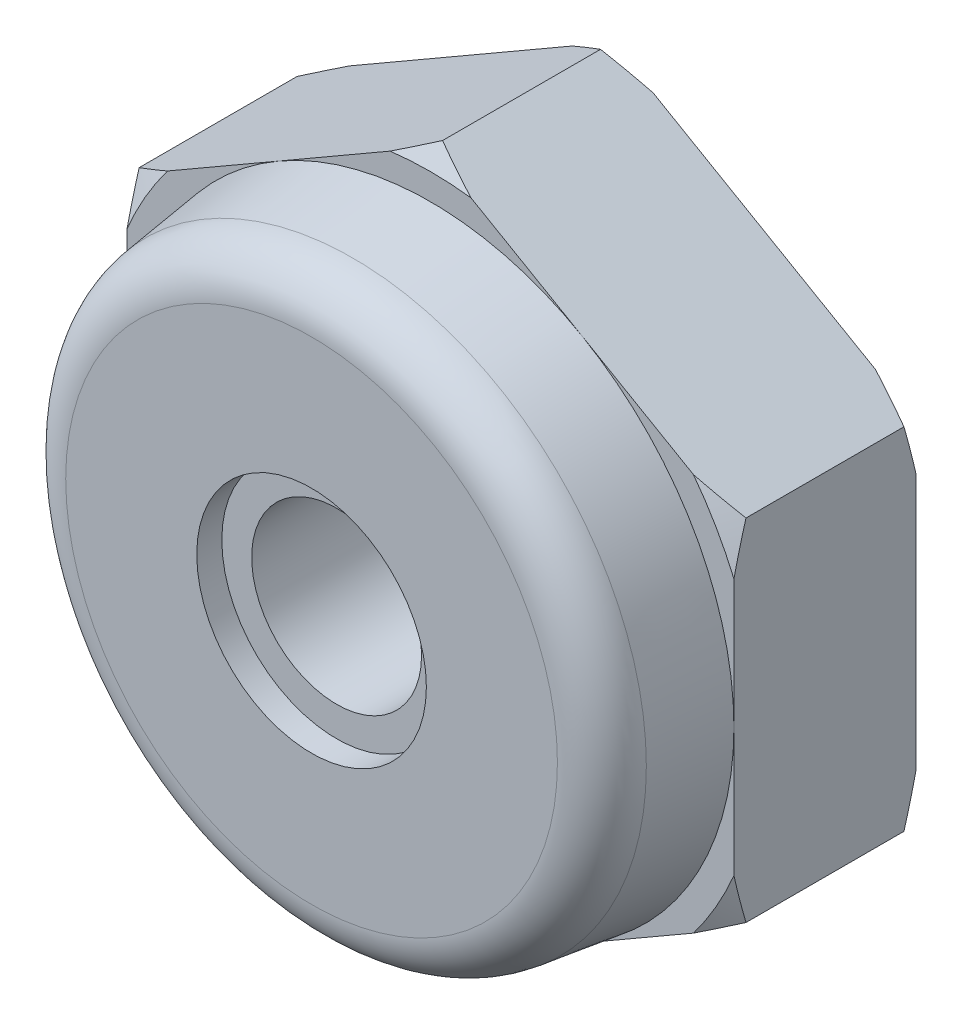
ISO-10303-21;
HEADER;
FILE_DESCRIPTION(('STEP AP214'),'2;1');
FILE_NAME('part.step','',(''),(''),'','','');
FILE_SCHEMA(('AUTOMOTIVE_DESIGN { 1 0 10303 214 1 1 1 1 }'));
ENDSEC;
DATA;
#1=APPLICATION_CONTEXT('core data for automotive mechanical design processes');
#2=APPLICATION_PROTOCOL_DEFINITION('international standard','automotive_design',2000,#1);
#3=PRODUCT_CONTEXT('',#1,'mechanical');
#4=PRODUCT('Part','Part','',(#3));
#5=PRODUCT_RELATED_PRODUCT_CATEGORY('part','',(#4));
#6=PRODUCT_DEFINITION_FORMATION('','',#4);
#7=PRODUCT_DEFINITION_CONTEXT('part definition',#1,'design');
#8=PRODUCT_DEFINITION('design','',#6,#7);
#9=PRODUCT_DEFINITION_SHAPE('','',#8);
#10=(LENGTH_UNIT() NAMED_UNIT(*) SI_UNIT(.MILLI.,.METRE.));
#11=(NAMED_UNIT(*) PLANE_ANGLE_UNIT() SI_UNIT($,.RADIAN.));
#12=(NAMED_UNIT(*) SI_UNIT($,.STERADIAN.) SOLID_ANGLE_UNIT());
#13=UNCERTAINTY_MEASURE_WITH_UNIT(LENGTH_MEASURE(1.E-05),#10,'distance_accuracy_value','');
#14=(GEOMETRIC_REPRESENTATION_CONTEXT(3) GLOBAL_UNCERTAINTY_ASSIGNED_CONTEXT((#13)) GLOBAL_UNIT_ASSIGNED_CONTEXT((#10,
#11,#12)) REPRESENTATION_CONTEXT('',''));
#15=CARTESIAN_POINT('',(0.,0.,0.));
#16=DIRECTION('',(0.,0.,1.));
#17=DIRECTION('',(1.,0.,0.));
#18=AXIS2_PLACEMENT_3D('',#15,#16,#17);
#19=CARTESIAN_POINT('',(3.175,-1.83308710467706,0.));
#20=DIRECTION('',(0.,0.,1.));
#21=DIRECTION('',(1.,0.,0.));
#22=AXIS2_PLACEMENT_3D('',#19,#20,#21);
#23=PLANE('',#22);
#24=DIRECTION('',(0.,1.,0.));
#25=VECTOR('',#24,1.);
#26=CARTESIAN_POINT('',(3.175,-1.83308710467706,0.));
#27=LINE('',#26,#25);
#28=CARTESIAN_POINT('',(3.175,0.,0.));
#29=VERTEX_POINT('',#28);
#30=CARTESIAN_POINT('',(3.175,1.34396658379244,0.));
#31=VERTEX_POINT('',#30);
#32=EDGE_CURVE('E474',#29,#31,#27,.T.);
#33=ORIENTED_EDGE('',*,*,#32,.T.);
#34=CARTESIAN_POINT('',(0.,0.,0.));
#35=DIRECTION('',(0.,0.,1.));
#36=DIRECTION('',(1.,0.,0.));
#37=AXIS2_PLACEMENT_3D('',#34,#35,#36);
#38=CIRCLE('',#37,3.44773420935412);
#39=CARTESIAN_POINT('',(2.75140920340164,2.07764736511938,0.));
#40=VERTEX_POINT('',#39);
#41=EDGE_CURVE('E182',#31,#40,#38,.T.);
#42=ORIENTED_EDGE('',*,*,#41,.T.);
#43=DIRECTION('',(-0.866025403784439,0.5,0.));
#44=VECTOR('',#43,1.);
#45=CARTESIAN_POINT('',(3.175,1.83308710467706,0.));
#46=LINE('',#45,#44);
#47=CARTESIAN_POINT('',(1.5875,2.74963065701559,0.));
#48=VERTEX_POINT('',#47);
#49=EDGE_CURVE('E198',#40,#48,#46,.T.);
#50=ORIENTED_EDGE('',*,*,#49,.T.);
#51=CARTESIAN_POINT('',(0.,0.,0.));
#52=DIRECTION('',(0.,0.,1.));
#53=DIRECTION('',(1.,0.,0.));
#54=AXIS2_PLACEMENT_3D('',#51,#52,#53);
#55=CIRCLE('',#54,3.175);
#56=EDGE_CURVE('E233',#29,#48,#55,.T.);
#57=ORIENTED_EDGE('',*,*,#56,.F.);
#58=EDGE_LOOP('',(#33,#42,#50,#57));
#59=FACE_BOUND('',#58,.T.);
#60=ADVANCED_FACE('F34',(#59),#23,.T.);
#61=CARTESIAN_POINT('',(0.423590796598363,3.42161394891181,0.));
#62=VERTEX_POINT('',#61);
#63=EDGE_CURVE('E478',#48,#62,#46,.T.);
#64=ORIENTED_EDGE('',*,*,#63,.T.);
#65=CARTESIAN_POINT('',(-0.423590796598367,3.42161394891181,0.));
#66=VERTEX_POINT('',#65);
#67=EDGE_CURVE('E444',#62,#66,#38,.T.);
#68=ORIENTED_EDGE('',*,*,#67,.T.);
#69=DIRECTION('',(-0.866025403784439,-0.5,0.));
#70=VECTOR('',#69,1.);
#71=CARTESIAN_POINT('',(0.,3.66617420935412,0.));
#72=LINE('',#71,#70);
#73=CARTESIAN_POINT('',(-1.5875,2.74963065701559,0.));
#74=VERTEX_POINT('',#73);
#75=EDGE_CURVE('E481',#66,#74,#72,.T.);
#76=ORIENTED_EDGE('',*,*,#75,.T.);
#77=EDGE_CURVE('E225',#48,#74,#55,.T.);
#78=ORIENTED_EDGE('',*,*,#77,.F.);
#79=EDGE_LOOP('',(#64,#68,#76,#78));
#80=FACE_BOUND('',#79,.T.);
#81=ADVANCED_FACE('F375',(#80),#23,.T.);
#82=CARTESIAN_POINT('',(-2.75140920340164,2.07764736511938,0.));
#83=VERTEX_POINT('',#82);
#84=EDGE_CURVE('E480',#74,#83,#72,.T.);
#85=ORIENTED_EDGE('',*,*,#84,.T.);
#86=CARTESIAN_POINT('',(-3.175,1.34396658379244,0.));
#87=VERTEX_POINT('',#86);
#88=EDGE_CURVE('E446',#83,#87,#38,.T.);
#89=ORIENTED_EDGE('',*,*,#88,.T.);
#90=DIRECTION('',(0.,-1.,0.));
#91=VECTOR('',#90,1.);
#92=CARTESIAN_POINT('',(-3.175,1.83308710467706,0.));
#93=LINE('',#92,#91);
#94=CARTESIAN_POINT('',(-3.175,0.,0.));
#95=VERTEX_POINT('',#94);
#96=EDGE_CURVE('E287',#87,#95,#93,.T.);
#97=ORIENTED_EDGE('',*,*,#96,.T.);
#98=EDGE_CURVE('E231',#74,#95,#55,.T.);
#99=ORIENTED_EDGE('',*,*,#98,.F.);
#100=EDGE_LOOP('',(#85,#89,#97,#99));
#101=FACE_BOUND('',#100,.T.);
#102=ADVANCED_FACE('F492',(#101),#23,.T.);
#103=CARTESIAN_POINT('',(-3.175,-1.34396658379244,0.));
#104=VERTEX_POINT('',#103);
#105=EDGE_CURVE('E482',#95,#104,#93,.T.);
#106=ORIENTED_EDGE('',*,*,#105,.T.);
#107=CARTESIAN_POINT('',(-2.75140920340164,-2.07764736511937,0.));
#108=VERTEX_POINT('',#107);
#109=EDGE_CURVE('E58',#104,#108,#38,.T.);
#110=ORIENTED_EDGE('',*,*,#109,.T.);
#111=DIRECTION('',(0.866025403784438,-0.5,0.));
#112=VECTOR('',#111,1.);
#113=CARTESIAN_POINT('',(-3.175,-1.83308710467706,0.));
#114=LINE('',#113,#112);
#115=CARTESIAN_POINT('',(-1.5875,-2.74963065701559,0.));
#116=VERTEX_POINT('',#115);
#117=EDGE_CURVE('E264',#108,#116,#114,.T.);
#118=ORIENTED_EDGE('',*,*,#117,.T.);
#119=EDGE_CURVE('E238',#95,#116,#55,.T.);
#120=ORIENTED_EDGE('',*,*,#119,.F.);
#121=EDGE_LOOP('',(#106,#110,#118,#120));
#122=FACE_BOUND('',#121,.T.);
#123=ADVANCED_FACE('F489',(#122),#23,.T.);
#124=CARTESIAN_POINT('',(-0.423590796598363,-3.42161394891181,0.));
#125=VERTEX_POINT('',#124);
#126=EDGE_CURVE('E483',#116,#125,#114,.T.);
#127=ORIENTED_EDGE('',*,*,#126,.T.);
#128=CARTESIAN_POINT('',(0.423590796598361,-3.42161394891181,0.));
#129=VERTEX_POINT('',#128);
#130=EDGE_CURVE('E50',#125,#129,#38,.T.);
#131=ORIENTED_EDGE('',*,*,#130,.T.);
#132=DIRECTION('',(0.866025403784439,0.5,0.));
#133=VECTOR('',#132,1.);
#134=CARTESIAN_POINT('',(0.,-3.66617420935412,0.));
#135=LINE('',#134,#133);
#136=CARTESIAN_POINT('',(1.5875,-2.74963065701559,0.));
#137=VERTEX_POINT('',#136);
#138=EDGE_CURVE('E472',#129,#137,#135,.T.);
#139=ORIENTED_EDGE('',*,*,#138,.T.);
#140=EDGE_CURVE('E251',#116,#137,#55,.T.);
#141=ORIENTED_EDGE('',*,*,#140,.F.);
#142=EDGE_LOOP('',(#127,#131,#139,#141));
#143=FACE_BOUND('',#142,.T.);
#144=ADVANCED_FACE('F576',(#143),#23,.T.);
#145=CARTESIAN_POINT('',(0.,-3.66617420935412,-1.905));
#146=DIRECTION('',(0.5,-0.866025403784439,0.));
#147=DIRECTION('',(0.866025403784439,0.5,0.));
#148=AXIS2_PLACEMENT_3D('',#145,#146,#147);
#149=PLANE('',#148);
#150=DIRECTION('',(0.,0.,1.));
#151=VECTOR('',#150,1.);
#152=CARTESIAN_POINT('',(3.175,-1.83308710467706,-1.905));
#153=LINE('',#152,#151);
#154=CARTESIAN_POINT('',(3.175,-1.83308710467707,-1.77888360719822));
#155=VERTEX_POINT('',#154);
#156=CARTESIAN_POINT('',(3.175,-1.83308710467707,-0.126116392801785));
#157=VERTEX_POINT('',#156);
#158=EDGE_CURVE('E206',#155,#157,#153,.T.);
#159=ORIENTED_EDGE('',*,*,#158,.T.);
#160=CARTESIAN_POINT('',(5.37620566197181,-0.562220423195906,-1.13032989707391));
#161=CARTESIAN_POINT('',(5.27647023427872,-0.61980269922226,-1.07652934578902));
#162=CARTESIAN_POINT('',(5.17649581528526,-0.677522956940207,-1.02331043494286));
#163=CARTESIAN_POINT('',(4.97596822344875,-0.793297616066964,-0.918309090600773));
#164=CARTESIAN_POINT('',(4.87541497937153,-0.851352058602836,-0.866526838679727));
#165=CARTESIAN_POINT('',(4.67332926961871,-0.968026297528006,-0.764521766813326));
#166=CARTESIAN_POINT('',(4.57179469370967,-1.02664731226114,-0.714304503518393));
#167=CARTESIAN_POINT('',(4.36796390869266,-1.14432907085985,-0.615979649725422));
#168=CARTESIAN_POINT('',(4.2656677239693,-1.20338980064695,-0.567871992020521));
#169=CARTESIAN_POINT('',(4.05759144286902,-1.32352269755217,-0.473043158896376));
#170=CARTESIAN_POINT('',(3.95178870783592,-1.38460793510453,-0.426387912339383));
#171=CARTESIAN_POINT('',(3.73911374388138,-1.50739588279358,-0.336408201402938));
#172=CARTESIAN_POINT('',(3.63224145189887,-1.5690986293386,-0.293083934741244));
#173=CARTESIAN_POINT('',(3.41740910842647,-1.69313214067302,-0.210594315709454));
#174=CARTESIAN_POINT('',(3.30945026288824,-1.75546220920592,-0.171424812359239));
#175=CARTESIAN_POINT('',(3.09225493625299,-1.88085998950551,-0.0981478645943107));
#176=CARTESIAN_POINT('',(2.98301855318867,-1.943927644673,-0.064040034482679));
#177=CARTESIAN_POINT('',(2.72175397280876,-2.09476882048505,0.00972945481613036));
#178=CARTESIAN_POINT('',(2.56912407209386,-2.18288973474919,0.046634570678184));
#179=CARTESIAN_POINT('',(2.26173087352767,-2.36036328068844,0.105701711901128));
#180=CARTESIAN_POINT('',(2.10696834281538,-2.44971546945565,0.127868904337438));
#181=CARTESIAN_POINT('',(1.79808495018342,-2.62804937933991,0.15489275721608));
#182=CARTESIAN_POINT('',(1.64397755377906,-2.71702332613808,0.159947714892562));
#183=CARTESIAN_POINT('',(1.33605939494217,-2.89479995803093,0.1526753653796));
#184=CARTESIAN_POINT('',(1.18224865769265,-2.9836026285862,0.140346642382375));
#185=CARTESIAN_POINT('',(0.924453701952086,-3.13244061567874,0.106172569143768));
#186=CARTESIAN_POINT('',(0.820024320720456,-3.19273294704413,0.0885439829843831));
#187=CARTESIAN_POINT('',(0.612150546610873,-3.31274892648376,0.0466748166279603));
#188=CARTESIAN_POINT('',(0.508706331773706,-3.37247247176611,0.022433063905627));
#189=CARTESIAN_POINT('',(0.302837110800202,-3.49133112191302,-0.0317544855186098));
#190=CARTESIAN_POINT('',(0.200413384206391,-3.55046548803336,-0.061706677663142));
#191=CARTESIAN_POINT('',(-0.00328333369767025,-3.66806984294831,-0.12636985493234));
#192=CARTESIAN_POINT('',(-0.104556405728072,-3.72653987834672,-0.161080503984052));
#193=CARTESIAN_POINT('',(-0.307218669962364,-3.84354699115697,-0.234871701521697));
#194=CARTESIAN_POINT('',(-0.408594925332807,-3.90207659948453,-0.27399930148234));
#195=CARTESIAN_POINT('',(-0.610270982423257,-4.01851432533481,-0.355534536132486));
#196=CARTESIAN_POINT('',(-0.710571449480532,-4.07642282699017,-0.397939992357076));
#197=CARTESIAN_POINT('',(-1.01009876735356,-4.24935500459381,-0.52916975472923));
#198=CARTESIAN_POINT('',(-1.20800238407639,-4.36361471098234,-0.622026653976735));
#199=CARTESIAN_POINT('',(-1.47183202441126,-4.51593682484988,-0.751545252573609));
#200=CARTESIAN_POINT('',(-1.5389681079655,-4.55469786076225,-0.785007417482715));
#201=CARTESIAN_POINT('',(-1.67295075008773,-4.63205277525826,-0.852694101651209));
#202=CARTESIAN_POINT('',(-1.73979731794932,-4.67064665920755,-0.886918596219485));
#203=CARTESIAN_POINT('',(-1.87253480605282,-4.74728268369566,-0.955677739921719));
#204=CARTESIAN_POINT('',(-1.93842843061,-4.78532638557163,-0.990205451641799));
#205=CARTESIAN_POINT('',(-2.06998468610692,-4.86128042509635,-1.05984642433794));
#206=CARTESIAN_POINT('',(-2.13564731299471,-4.89919076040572,-1.09495969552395));
#207=CARTESIAN_POINT('',(-2.20120566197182,-4.93704089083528,-1.1303298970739));
#208=B_SPLINE_CURVE_WITH_KNOTS('',3,(#160,#161,#162,#163,#164,#165,#166,#167,#168,#169,#170,
#171,#172,#173,#174,#175,#176,#177,#178,#179,#180,#181,#182,#183,#184,#185,#186,#187,#188,#189,
#190,#191,#192,#193,#194,#195,#196,#197,#198,#199,#200,#201,#202,#203,#204,#205,#206,#207),
.UNSPECIFIED.,.F.,.F.,(4,2,2,2,2,2,2,2,2,2,2,2,2,2,2,2,2,2,2,2,2,2,2,4),(0.,0.38133907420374,
0.762726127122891,1.14534092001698,1.52794351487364,1.92023172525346,2.31254320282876,
2.70445895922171,3.09634483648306,3.63602269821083,4.1755112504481,4.70872638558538,
5.24198495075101,5.60739948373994,5.97287884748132,6.338769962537,6.7046352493,7.07485072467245,
7.44482223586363,8.18458013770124,8.43788818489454,8.6911880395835,8.94185107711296,
9.1925184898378),.UNSPECIFIED.);
#209=CARTESIAN_POINT('',(2.75140920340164,-2.07764736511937,0.));
#210=VERTEX_POINT('',#209);
#211=EDGE_CURVE('E187',#157,#210,#208,.T.);
#212=ORIENTED_EDGE('',*,*,#211,.T.);
#213=EDGE_CURVE('E475',#137,#210,#135,.T.);
#214=ORIENTED_EDGE('',*,*,#213,.F.);
#215=ORIENTED_EDGE('',*,*,#138,.F.);
#216=CARTESIAN_POINT('',(0.,-3.66617420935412,-0.126116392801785));
#217=VERTEX_POINT('',#216);
#218=EDGE_CURVE('E431',#129,#217,#208,.T.);
#219=ORIENTED_EDGE('',*,*,#218,.T.);
#220=DIRECTION('',(0.,0.,1.));
#221=VECTOR('',#220,1.);
#222=CARTESIAN_POINT('',(0.,-3.66617420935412,-1.905));
#223=LINE('',#222,#221);
#224=CARTESIAN_POINT('',(0.,-3.66617420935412,-1.77888360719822));
#225=VERTEX_POINT('',#224);
#226=EDGE_CURVE('E252',#225,#217,#223,.T.);
#227=ORIENTED_EDGE('',*,*,#226,.F.);
#228=CARTESIAN_POINT('',(5.37620566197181,-0.562220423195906,-0.774670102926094));
#229=CARTESIAN_POINT('',(5.27647023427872,-0.61980269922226,-0.828470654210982));
#230=CARTESIAN_POINT('',(5.17649581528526,-0.677522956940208,-0.881689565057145));
#231=CARTESIAN_POINT('',(4.97596822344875,-0.793297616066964,-0.986690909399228));
#232=CARTESIAN_POINT('',(4.87541497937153,-0.851352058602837,-1.03847316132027));
#233=CARTESIAN_POINT('',(4.67332926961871,-0.968026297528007,-1.14047823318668));
#234=CARTESIAN_POINT('',(4.57179469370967,-1.02664731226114,-1.19069549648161));
#235=CARTESIAN_POINT('',(4.36796390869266,-1.14432907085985,-1.28902035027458));
#236=CARTESIAN_POINT('',(4.2656677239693,-1.20338980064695,-1.33712800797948));
#237=CARTESIAN_POINT('',(4.05759144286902,-1.32352269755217,-1.43195684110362));
#238=CARTESIAN_POINT('',(3.95178870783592,-1.38460793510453,-1.47861208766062));
#239=CARTESIAN_POINT('',(3.73911374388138,-1.50739588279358,-1.56859179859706));
#240=CARTESIAN_POINT('',(3.63224145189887,-1.5690986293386,-1.61191606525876));
#241=CARTESIAN_POINT('',(3.41740910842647,-1.69313214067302,-1.69440568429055));
#242=CARTESIAN_POINT('',(3.30945026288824,-1.75546220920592,-1.73357518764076));
#243=CARTESIAN_POINT('',(3.09225493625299,-1.88085998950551,-1.80685213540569));
#244=CARTESIAN_POINT('',(2.98301855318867,-1.943927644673,-1.84095996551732));
#245=CARTESIAN_POINT('',(2.72175397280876,-2.09476882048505,-1.91472945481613));
#246=CARTESIAN_POINT('',(2.56912407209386,-2.18288973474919,-1.95163457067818));
#247=CARTESIAN_POINT('',(2.26173087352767,-2.36036328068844,-2.01070171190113));
#248=CARTESIAN_POINT('',(2.10696834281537,-2.44971546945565,-2.03286890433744));
#249=CARTESIAN_POINT('',(1.79808495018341,-2.62804937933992,-2.05989275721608));
#250=CARTESIAN_POINT('',(1.64397755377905,-2.71702332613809,-2.06494771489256));
#251=CARTESIAN_POINT('',(1.33605939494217,-2.89479995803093,-2.0576753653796));
#252=CARTESIAN_POINT('',(1.18224865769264,-2.9836026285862,-2.04534664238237));
#253=CARTESIAN_POINT('',(0.92445370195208,-3.13244061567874,-2.01117256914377));
#254=CARTESIAN_POINT('',(0.82002432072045,-3.19273294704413,-1.99354398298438));
#255=CARTESIAN_POINT('',(0.612150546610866,-3.31274892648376,-1.95167481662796));
#256=CARTESIAN_POINT('',(0.508706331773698,-3.37247247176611,-1.92743306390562));
#257=CARTESIAN_POINT('',(0.302837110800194,-3.49133112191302,-1.87324551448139));
#258=CARTESIAN_POINT('',(0.200413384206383,-3.55046548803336,-1.84329332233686));
#259=CARTESIAN_POINT('',(-0.00328333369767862,-3.66806984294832,-1.77863014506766));
#260=CARTESIAN_POINT('',(-0.104556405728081,-3.72653987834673,-1.74391949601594));
#261=CARTESIAN_POINT('',(-0.307218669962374,-3.84354699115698,-1.6701282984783));
#262=CARTESIAN_POINT('',(-0.408594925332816,-3.90207659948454,-1.63100069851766));
#263=CARTESIAN_POINT('',(-0.610270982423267,-4.01851432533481,-1.54946546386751));
#264=CARTESIAN_POINT('',(-0.710571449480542,-4.07642282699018,-1.50706000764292));
#265=CARTESIAN_POINT('',(-1.01009876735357,-4.24935500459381,-1.37583024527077));
#266=CARTESIAN_POINT('',(-1.2080023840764,-4.36361471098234,-1.28297334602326));
#267=CARTESIAN_POINT('',(-1.47183202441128,-4.51593682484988,-1.15345474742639));
#268=CARTESIAN_POINT('',(-1.53896810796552,-4.55469786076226,-1.11999258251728));
#269=CARTESIAN_POINT('',(-1.67295075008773,-4.63205277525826,-1.05230589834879));
#270=CARTESIAN_POINT('',(-1.73979731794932,-4.67064665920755,-1.01808140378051));
#271=CARTESIAN_POINT('',(-1.87253480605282,-4.74728268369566,-0.949322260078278));
#272=CARTESIAN_POINT('',(-1.93842843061,-4.78532638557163,-0.9147945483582));
#273=CARTESIAN_POINT('',(-2.06998468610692,-4.86128042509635,-0.845153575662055));
#274=CARTESIAN_POINT('',(-2.13564731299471,-4.89919076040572,-0.810040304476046));
#275=CARTESIAN_POINT('',(-2.20120566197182,-4.93704089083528,-0.774670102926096));
#276=B_SPLINE_CURVE_WITH_KNOTS('',3,(#228,#229,#230,#231,#232,#233,#234,#235,#236,#237,#238,
#239,#240,#241,#242,#243,#244,#245,#246,#247,#248,#249,#250,#251,#252,#253,#254,#255,#256,#257,
#258,#259,#260,#261,#262,#263,#264,#265,#266,#267,#268,#269,#270,#271,#272,#273,#274,#275),
.UNSPECIFIED.,.F.,.F.,(4,2,2,2,2,2,2,2,2,2,2,2,2,2,2,2,2,2,2,2,2,2,2,4),(0.,0.381339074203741,
0.762726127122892,1.14534092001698,1.52794351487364,1.92023172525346,2.31254320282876,
2.70445895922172,3.09634483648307,3.63602269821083,4.1755112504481,4.70872638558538,
5.24198495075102,5.60739948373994,5.97287884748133,6.33876996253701,6.70463524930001,
7.07485072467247,7.44482223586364,8.18458013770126,8.43788818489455,8.69118803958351,
8.94185107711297,9.1925184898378),.UNSPECIFIED.);
#277=CARTESIAN_POINT('',(0.423590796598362,-3.42161394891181,-1.905));
#278=VERTEX_POINT('',#277);
#279=EDGE_CURVE('E242',#278,#225,#276,.T.);
#280=ORIENTED_EDGE('',*,*,#279,.F.);
#281=DIRECTION('',(0.866025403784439,0.5,0.));
#282=VECTOR('',#281,1.);
#283=CARTESIAN_POINT('',(0.,-3.66617420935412,-1.905));
#284=LINE('',#283,#282);
#285=CARTESIAN_POINT('',(2.75140920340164,-2.07764736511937,-1.905));
#286=VERTEX_POINT('',#285);
#287=EDGE_CURVE('E460',#278,#286,#284,.T.);
#288=ORIENTED_EDGE('',*,*,#287,.T.);
#289=EDGE_CURVE('E250',#155,#286,#276,.T.);
#290=ORIENTED_EDGE('',*,*,#289,.F.);
#291=EDGE_LOOP('',(#159,#212,#214,#215,#219,#227,#280,#288,#290));
#292=FACE_BOUND('',#291,.T.);
#293=ADVANCED_FACE('F36',(#292),#149,.T.);
#294=CARTESIAN_POINT('',(-3.175,-1.83308710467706,-1.905));
#295=DIRECTION('',(-0.5,-0.866025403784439,0.));
#296=DIRECTION('',(0.866025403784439,-0.5,0.));
#297=AXIS2_PLACEMENT_3D('',#294,#295,#296);
#298=PLANE('',#297);
#299=ORIENTED_EDGE('',*,*,#226,.T.);
#300=CARTESIAN_POINT('',(2.20120566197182,-4.93704089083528,-1.13032989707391));
#301=CARTESIAN_POINT('',(2.10147023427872,-4.87945861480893,-1.07652934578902));
#302=CARTESIAN_POINT('',(2.00149581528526,-4.82173835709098,-1.02331043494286));
#303=CARTESIAN_POINT('',(1.80096822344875,-4.70596369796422,-0.918309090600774));
#304=CARTESIAN_POINT('',(1.70041497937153,-4.64790925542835,-0.866526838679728));
#305=CARTESIAN_POINT('',(1.49832926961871,-4.53123501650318,-0.764521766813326));
#306=CARTESIAN_POINT('',(1.39679469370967,-4.47261400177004,-0.714304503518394));
#307=CARTESIAN_POINT('',(1.19296390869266,-4.35493224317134,-0.615979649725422));
#308=CARTESIAN_POINT('',(1.0906677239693,-4.29587151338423,-0.567871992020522));
#309=CARTESIAN_POINT('',(0.882591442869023,-4.17573861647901,-0.473043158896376));
#310=CARTESIAN_POINT('',(0.776788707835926,-4.11465337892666,-0.426387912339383));
#311=CARTESIAN_POINT('',(0.564113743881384,-3.99186543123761,-0.336408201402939));
#312=CARTESIAN_POINT('',(0.457241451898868,-3.93016268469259,-0.293083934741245));
#313=CARTESIAN_POINT('',(0.242409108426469,-3.80612917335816,-0.210594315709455));
#314=CARTESIAN_POINT('',(0.134450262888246,-3.74379910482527,-0.17142481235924));
#315=CARTESIAN_POINT('',(-0.0827450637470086,-3.61840132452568,-0.098147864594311));
#316=CARTESIAN_POINT('',(-0.191981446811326,-3.55533366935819,-0.0640400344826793));
#317=CARTESIAN_POINT('',(-0.453246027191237,-3.40449249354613,0.00972945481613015));
#318=CARTESIAN_POINT('',(-0.605875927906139,-3.316371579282,0.0466345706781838));
#319=CARTESIAN_POINT('',(-0.91326912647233,-3.13889803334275,0.105701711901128));
#320=CARTESIAN_POINT('',(-1.06803165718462,-3.04954584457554,0.127868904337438));
#321=CARTESIAN_POINT('',(-1.37691504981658,-2.87121193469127,0.15489275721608));
#322=CARTESIAN_POINT('',(-1.53102244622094,-2.7822379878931,0.159947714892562));
#323=CARTESIAN_POINT('',(-1.83894060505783,-2.60446135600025,0.1526753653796));
#324=CARTESIAN_POINT('',(-1.99275134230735,-2.51565868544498,0.140346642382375));
#325=CARTESIAN_POINT('',(-2.25054629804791,-2.36682069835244,0.106172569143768));
#326=CARTESIAN_POINT('',(-2.35497567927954,-2.30652836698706,0.0885439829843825));
#327=CARTESIAN_POINT('',(-2.56284945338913,-2.18651238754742,0.0466748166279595));
#328=CARTESIAN_POINT('',(-2.6662936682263,-2.12678884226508,0.0224330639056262));
#329=CARTESIAN_POINT('',(-2.8721628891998,-2.00793019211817,-0.0317544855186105));
#330=CARTESIAN_POINT('',(-2.97458661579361,-1.94879582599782,-0.0617066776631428));
#331=CARTESIAN_POINT('',(-3.17828333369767,-1.83119147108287,-0.12636985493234));
#332=CARTESIAN_POINT('',(-3.27955640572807,-1.77272143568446,-0.161080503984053));
#333=CARTESIAN_POINT('',(-3.48221866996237,-1.65571432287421,-0.234871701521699));
#334=CARTESIAN_POINT('',(-3.58359492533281,-1.59718471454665,-0.273999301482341));
#335=CARTESIAN_POINT('',(-3.78527098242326,-1.48074698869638,-0.355534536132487));
#336=CARTESIAN_POINT('',(-3.88557144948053,-1.42283848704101,-0.397939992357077));
#337=CARTESIAN_POINT('',(-4.18509876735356,-1.24990630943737,-0.529169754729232));
#338=CARTESIAN_POINT('',(-4.38300238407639,-1.13564660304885,-0.622026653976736));
#339=CARTESIAN_POINT('',(-4.64683202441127,-0.983324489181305,-0.751545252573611));
#340=CARTESIAN_POINT('',(-4.71396810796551,-0.944563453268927,-0.785007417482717));
#341=CARTESIAN_POINT('',(-4.84795075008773,-0.867208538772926,-0.852694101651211));
#342=CARTESIAN_POINT('',(-4.91479731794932,-0.828614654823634,-0.886918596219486));
#343=CARTESIAN_POINT('',(-5.04753480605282,-0.751978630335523,-0.955677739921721));
#344=CARTESIAN_POINT('',(-5.11342843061,-0.713934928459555,-0.9902054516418));
#345=CARTESIAN_POINT('',(-5.24498468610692,-0.637980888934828,-1.05984642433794));
#346=CARTESIAN_POINT('',(-5.31064731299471,-0.600070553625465,-1.09495969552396));
#347=CARTESIAN_POINT('',(-5.37620566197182,-0.562220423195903,-1.13032989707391));
#348=B_SPLINE_CURVE_WITH_KNOTS('',3,(#300,#301,#302,#303,#304,#305,#306,#307,#308,#309,#310,
#311,#312,#313,#314,#315,#316,#317,#318,#319,#320,#321,#322,#323,#324,#325,#326,#327,#328,#329,
#330,#331,#332,#333,#334,#335,#336,#337,#338,#339,#340,#341,#342,#343,#344,#345,#346,#347),
.UNSPECIFIED.,.F.,.F.,(4,2,2,2,2,2,2,2,2,2,2,2,2,2,2,2,2,2,2,2,2,2,2,4),(0.,0.38133907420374,
0.762726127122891,1.14534092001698,1.52794351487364,1.92023172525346,2.31254320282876,
2.70445895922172,3.09634483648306,3.63602269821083,4.1755112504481,4.70872638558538,
5.24198495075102,5.60739948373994,5.97287884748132,6.338769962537,6.7046352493,7.07485072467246,
7.44482223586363,8.18458013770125,8.43788818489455,8.69118803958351,8.94185107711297,
9.1925184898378),.UNSPECIFIED.);
#349=EDGE_CURVE('E437',#217,#125,#348,.T.);
#350=ORIENTED_EDGE('',*,*,#349,.T.);
#351=ORIENTED_EDGE('',*,*,#126,.F.);
#352=ORIENTED_EDGE('',*,*,#117,.F.);
#353=CARTESIAN_POINT('',(-3.175,-1.83308710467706,-0.126116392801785));
#354=VERTEX_POINT('',#353);
#355=EDGE_CURVE('E292',#108,#354,#348,.T.);
#356=ORIENTED_EDGE('',*,*,#355,.T.);
#357=DIRECTION('',(0.,0.,1.));
#358=VECTOR('',#357,1.);
#359=CARTESIAN_POINT('',(-3.175,-1.83308710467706,-1.905));
#360=LINE('',#359,#358);
#361=CARTESIAN_POINT('',(-3.175,-1.83308710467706,-1.77888360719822));
#362=VERTEX_POINT('',#361);
#363=EDGE_CURVE('E256',#362,#354,#360,.T.);
#364=ORIENTED_EDGE('',*,*,#363,.F.);
#365=CARTESIAN_POINT('',(2.20120566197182,-4.93704089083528,-0.774670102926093));
#366=CARTESIAN_POINT('',(2.10147023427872,-4.87945861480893,-0.828470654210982));
#367=CARTESIAN_POINT('',(2.00149581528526,-4.82173835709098,-0.881689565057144));
#368=CARTESIAN_POINT('',(1.80096822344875,-4.70596369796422,-0.986690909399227));
#369=CARTESIAN_POINT('',(1.70041497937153,-4.64790925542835,-1.03847316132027));
#370=CARTESIAN_POINT('',(1.49832926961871,-4.53123501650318,-1.14047823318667));
#371=CARTESIAN_POINT('',(1.39679469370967,-4.47261400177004,-1.19069549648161));
#372=CARTESIAN_POINT('',(1.19296390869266,-4.35493224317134,-1.28902035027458));
#373=CARTESIAN_POINT('',(1.0906677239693,-4.29587151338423,-1.33712800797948));
#374=CARTESIAN_POINT('',(0.882591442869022,-4.17573861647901,-1.43195684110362));
#375=CARTESIAN_POINT('',(0.776788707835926,-4.11465337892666,-1.47861208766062));
#376=CARTESIAN_POINT('',(0.564113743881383,-3.99186543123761,-1.56859179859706));
#377=CARTESIAN_POINT('',(0.457241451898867,-3.93016268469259,-1.61191606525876));
#378=CARTESIAN_POINT('',(0.242409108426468,-3.80612917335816,-1.69440568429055));
#379=CARTESIAN_POINT('',(0.134450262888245,-3.74379910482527,-1.73357518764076));
#380=CARTESIAN_POINT('',(-0.082745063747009,-3.61840132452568,-1.80685213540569));
#381=CARTESIAN_POINT('',(-0.191981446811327,-3.55533366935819,-1.84095996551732));
#382=CARTESIAN_POINT('',(-0.453246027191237,-3.40449249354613,-1.91472945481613));
#383=CARTESIAN_POINT('',(-0.60587592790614,-3.316371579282,-1.95163457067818));
#384=CARTESIAN_POINT('',(-0.91326912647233,-3.13889803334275,-2.01070171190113));
#385=CARTESIAN_POINT('',(-1.06803165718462,-3.04954584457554,-2.03286890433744));
#386=CARTESIAN_POINT('',(-1.37691504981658,-2.87121193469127,-2.05989275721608));
#387=CARTESIAN_POINT('',(-1.53102244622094,-2.7822379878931,-2.06494771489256));
#388=CARTESIAN_POINT('',(-1.83894060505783,-2.60446135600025,-2.0576753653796));
#389=CARTESIAN_POINT('',(-1.99275134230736,-2.51565868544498,-2.04534664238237));
#390=CARTESIAN_POINT('',(-2.25054629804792,-2.36682069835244,-2.01117256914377));
#391=CARTESIAN_POINT('',(-2.35497567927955,-2.30652836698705,-1.99354398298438));
#392=CARTESIAN_POINT('',(-2.56284945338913,-2.18651238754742,-1.95167481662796));
#393=CARTESIAN_POINT('',(-2.6662936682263,-2.12678884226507,-1.92743306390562));
#394=CARTESIAN_POINT('',(-2.8721628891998,-2.00793019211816,-1.87324551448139));
#395=CARTESIAN_POINT('',(-2.97458661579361,-1.94879582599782,-1.84329332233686));
#396=CARTESIAN_POINT('',(-3.17828333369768,-1.83119147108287,-1.77863014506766));
#397=CARTESIAN_POINT('',(-3.27955640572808,-1.77272143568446,-1.74391949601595));
#398=CARTESIAN_POINT('',(-3.48221866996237,-1.65571432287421,-1.6701282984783));
#399=CARTESIAN_POINT('',(-3.58359492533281,-1.59718471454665,-1.63100069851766));
#400=CARTESIAN_POINT('',(-3.78527098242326,-1.48074698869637,-1.54946546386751));
#401=CARTESIAN_POINT('',(-3.88557144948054,-1.42283848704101,-1.50706000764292));
#402=CARTESIAN_POINT('',(-4.18509876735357,-1.24990630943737,-1.37583024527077));
#403=CARTESIAN_POINT('',(-4.3830023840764,-1.13564660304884,-1.28297334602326));
#404=CARTESIAN_POINT('',(-4.64683202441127,-0.9833244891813,-1.15345474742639));
#405=CARTESIAN_POINT('',(-4.71396810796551,-0.944563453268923,-1.11999258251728));
#406=CARTESIAN_POINT('',(-4.84795075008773,-0.867208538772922,-1.05230589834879));
#407=CARTESIAN_POINT('',(-4.91479731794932,-0.828614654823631,-1.01808140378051));
#408=CARTESIAN_POINT('',(-5.04753480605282,-0.751978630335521,-0.949322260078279));
#409=CARTESIAN_POINT('',(-5.11342843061,-0.713934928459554,-0.9147945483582));
#410=CARTESIAN_POINT('',(-5.24498468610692,-0.637980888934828,-0.845153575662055));
#411=CARTESIAN_POINT('',(-5.31064731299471,-0.600070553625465,-0.810040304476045));
#412=CARTESIAN_POINT('',(-5.37620566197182,-0.562220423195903,-0.774670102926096));
#413=B_SPLINE_CURVE_WITH_KNOTS('',3,(#365,#366,#367,#368,#369,#370,#371,#372,#373,#374,#375,
#376,#377,#378,#379,#380,#381,#382,#383,#384,#385,#386,#387,#388,#389,#390,#391,#392,#393,#394,
#395,#396,#397,#398,#399,#400,#401,#402,#403,#404,#405,#406,#407,#408,#409,#410,#411,#412),
.UNSPECIFIED.,.F.,.F.,(4,2,2,2,2,2,2,2,2,2,2,2,2,2,2,2,2,2,2,2,2,2,2,4),(0.,0.381339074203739,
0.762726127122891,1.14534092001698,1.52794351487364,1.92023172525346,2.31254320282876,
2.70445895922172,3.09634483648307,3.63602269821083,4.1755112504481,4.70872638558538,
5.24198495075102,5.60739948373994,5.97287884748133,6.33876996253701,6.70463524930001,
7.07485072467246,7.44482223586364,8.18458013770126,8.43788818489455,8.69118803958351,
8.94185107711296,9.1925184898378),.UNSPECIFIED.);
#414=CARTESIAN_POINT('',(-2.75140920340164,-2.07764736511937,-1.905));
#415=VERTEX_POINT('',#414);
#416=EDGE_CURVE('E364',#415,#362,#413,.T.);
#417=ORIENTED_EDGE('',*,*,#416,.F.);
#418=DIRECTION('',(0.866025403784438,-0.5,0.));
#419=VECTOR('',#418,1.);
#420=CARTESIAN_POINT('',(-3.175,-1.83308710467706,-1.905));
#421=LINE('',#420,#419);
#422=CARTESIAN_POINT('',(-0.423590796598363,-3.42161394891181,-1.905));
#423=VERTEX_POINT('',#422);
#424=EDGE_CURVE('E211',#415,#423,#421,.T.);
#425=ORIENTED_EDGE('',*,*,#424,.T.);
#426=EDGE_CURVE('E248',#225,#423,#413,.T.);
#427=ORIENTED_EDGE('',*,*,#426,.F.);
#428=EDGE_LOOP('',(#299,#350,#351,#352,#356,#364,#417,#425,#427));
#429=FACE_BOUND('',#428,.T.);
#430=ADVANCED_FACE('F368',(#429),#298,.T.);
#431=CARTESIAN_POINT('',(-3.175,1.83308710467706,-1.905));
#432=DIRECTION('',(-1.,0.,0.));
#433=DIRECTION('',(0.,0.,1.));
#434=AXIS2_PLACEMENT_3D('',#431,#432,#433);
#435=PLANE('',#434);
#436=ORIENTED_EDGE('',*,*,#363,.T.);
#437=CARTESIAN_POINT('',(-3.175,-4.03429276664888,-0.973464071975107));
#438=CARTESIAN_POINT('',(-3.175,-3.91960402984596,-0.921444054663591));
#439=CARTESIAN_POINT('',(-3.175,-3.80460134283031,-0.870103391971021));
#440=CARTESIAN_POINT('',(-3.175,-3.57383321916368,-0.769110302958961));
#441=CARTESIAN_POINT('',(-3.175,-3.45806764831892,-0.719458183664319));
#442=CARTESIAN_POINT('',(-3.175,-3.22519372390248,-0.621987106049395));
#443=CARTESIAN_POINT('',(-3.175,-3.10808177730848,-0.574176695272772));
#444=CARTESIAN_POINT('',(-3.175,-2.87286811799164,-0.481066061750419));
#445=CARTESIAN_POINT('',(-3.175,-2.75476645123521,-0.435765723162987));
#446=CARTESIAN_POINT('',(-3.175,-2.51796094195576,-0.348430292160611));
#447=CARTESIAN_POINT('',(-3.175,-2.39926228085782,-0.30638128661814));
#448=CARTESIAN_POINT('',(-3.175,-2.160611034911,-0.22601439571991));
#449=CARTESIAN_POINT('',(-3.175,-2.04065837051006,-0.187696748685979));
#450=CARTESIAN_POINT('',(-3.175,-1.67904679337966,-0.0796555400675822));
#451=CARTESIAN_POINT('',(-3.175,-1.4352439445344,-0.0166942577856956));
#452=CARTESIAN_POINT('',(-3.175,-1.01195042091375,0.0689736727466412));
#453=CARTESIAN_POINT('',(-3.175,-0.833764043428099,0.0980285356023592));
#454=CARTESIAN_POINT('',(-3.175,-0.475468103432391,0.139785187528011));
#455=CARTESIAN_POINT('',(-3.175,-0.29535920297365,0.152492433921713));
#456=CARTESIAN_POINT('',(-3.175,0.0651552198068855,0.160025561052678));
#457=CARTESIAN_POINT('',(-3.175,0.245560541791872,0.154860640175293));
#458=CARTESIAN_POINT('',(-3.175,0.605020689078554,0.12732166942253));
#459=CARTESIAN_POINT('',(-3.175,0.784075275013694,0.104944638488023));
#460=CARTESIAN_POINT('',(-3.175,1.2278900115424,0.030669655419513));
#461=CARTESIAN_POINT('',(-3.175,1.49110281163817,-0.030366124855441));
#462=CARTESIAN_POINT('',(-3.175,1.88112764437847,-0.13910027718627));
#463=CARTESIAN_POINT('',(-3.175,2.01050435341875,-0.178271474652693));
#464=CARTESIAN_POINT('',(-3.175,2.267764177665,-0.261264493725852));
#465=CARTESIAN_POINT('',(-3.175,2.39564739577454,-0.305085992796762));
#466=CARTESIAN_POINT('',(-3.175,2.65149404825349,-0.396979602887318));
#467=CARTESIAN_POINT('',(-3.175,2.77944205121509,-0.445094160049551));
#468=CARTESIAN_POINT('',(-3.175,3.03414583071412,-0.544395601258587));
#469=CARTESIAN_POINT('',(-3.175,3.16090153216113,-0.595582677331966));
#470=CARTESIAN_POINT('',(-3.175,3.41260387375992,-0.700104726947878));
#471=CARTESIAN_POINT('',(-3.175,3.53755684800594,-0.753424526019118));
#472=CARTESIAN_POINT('',(-3.175,3.78655868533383,-0.862056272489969));
#473=CARTESIAN_POINT('',(-3.175,3.91060776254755,-0.917367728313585));
#474=CARTESIAN_POINT('',(-3.175,4.03429276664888,-0.973464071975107));
#475=B_SPLINE_CURVE_WITH_KNOTS('',3,(#437,#438,#439,#440,#441,#442,#443,#444,#445,#446,#447,
#448,#449,#450,#451,#452,#453,#454,#455,#456,#457,#458,#459,#460,#461,#462,#463,#464,#465,#466,
#467,#468,#469,#470,#471,#472,#473,#474),.UNSPECIFIED.,.F.,.F.,(4,2,2,2,2,2,2,2,2,2,2,2,2,2,2,2,
2,2,4),(0.,0.377810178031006,0.755688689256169,1.13514965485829,1.51459309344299,
1.89231085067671,2.27005271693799,3.02428474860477,3.56528719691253,4.1061089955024,
4.64665248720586,5.18728961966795,5.99612403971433,6.40161249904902,6.80707285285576,
7.21711612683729,7.62718505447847,8.03472779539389,8.44217062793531),.UNSPECIFIED.);
#476=EDGE_CURVE('E290',#354,#104,#475,.T.);
#477=ORIENTED_EDGE('',*,*,#476,.T.);
#478=ORIENTED_EDGE('',*,*,#105,.F.);
#479=ORIENTED_EDGE('',*,*,#96,.F.);
#480=CARTESIAN_POINT('',(-3.175,1.83308710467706,-0.126116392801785));
#481=VERTEX_POINT('',#480);
#482=EDGE_CURVE('E285',#87,#481,#475,.T.);
#483=ORIENTED_EDGE('',*,*,#482,.T.);
#484=DIRECTION('',(0.,0.,1.));
#485=VECTOR('',#484,1.);
#486=CARTESIAN_POINT('',(-3.175,1.83308710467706,-1.905));
#487=LINE('',#486,#485);
#488=CARTESIAN_POINT('',(-3.175,1.83308710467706,-1.77888360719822));
#489=VERTEX_POINT('',#488);
#490=EDGE_CURVE('E208',#489,#481,#487,.T.);
#491=ORIENTED_EDGE('',*,*,#490,.F.);
#492=CARTESIAN_POINT('',(-3.175,-4.03429276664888,-0.931535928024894));
#493=CARTESIAN_POINT('',(-3.175,-3.91960402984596,-0.98355594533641));
#494=CARTESIAN_POINT('',(-3.175,-3.80460134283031,-1.03489660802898));
#495=CARTESIAN_POINT('',(-3.175,-3.57383321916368,-1.13588969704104));
#496=CARTESIAN_POINT('',(-3.175,-3.45806764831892,-1.18554181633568));
#497=CARTESIAN_POINT('',(-3.175,-3.22519372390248,-1.28301289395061));
#498=CARTESIAN_POINT('',(-3.175,-3.10808177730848,-1.33082330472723));
#499=CARTESIAN_POINT('',(-3.175,-2.87286811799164,-1.42393393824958));
#500=CARTESIAN_POINT('',(-3.175,-2.75476645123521,-1.46923427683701));
#501=CARTESIAN_POINT('',(-3.175,-2.51796094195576,-1.55656970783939));
#502=CARTESIAN_POINT('',(-3.175,-2.39926228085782,-1.59861871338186));
#503=CARTESIAN_POINT('',(-3.175,-2.160611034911,-1.67898560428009));
#504=CARTESIAN_POINT('',(-3.175,-2.04065837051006,-1.71730325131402));
#505=CARTESIAN_POINT('',(-3.175,-1.67904679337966,-1.82534445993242));
#506=CARTESIAN_POINT('',(-3.175,-1.4352439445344,-1.8883057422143));
#507=CARTESIAN_POINT('',(-3.175,-1.01195042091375,-1.97397367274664));
#508=CARTESIAN_POINT('',(-3.175,-0.833764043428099,-2.00302853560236));
#509=CARTESIAN_POINT('',(-3.175,-0.47546810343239,-2.04478518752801));
#510=CARTESIAN_POINT('',(-3.175,-0.295359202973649,-2.05749243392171));
#511=CARTESIAN_POINT('',(-3.175,0.0651552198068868,-2.06502556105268));
#512=CARTESIAN_POINT('',(-3.175,0.245560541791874,-2.05986064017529));
#513=CARTESIAN_POINT('',(-3.175,0.605020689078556,-2.03232166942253));
#514=CARTESIAN_POINT('',(-3.175,0.784075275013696,-2.00994463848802));
#515=CARTESIAN_POINT('',(-3.175,1.2278900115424,-1.93566965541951));
#516=CARTESIAN_POINT('',(-3.175,1.49110281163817,-1.87463387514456));
#517=CARTESIAN_POINT('',(-3.175,1.88112764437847,-1.76589972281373));
#518=CARTESIAN_POINT('',(-3.175,2.01050435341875,-1.72672852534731));
#519=CARTESIAN_POINT('',(-3.175,2.26776417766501,-1.64373550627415));
#520=CARTESIAN_POINT('',(-3.175,2.39564739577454,-1.59991400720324));
#521=CARTESIAN_POINT('',(-3.175,2.65149404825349,-1.50802039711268));
#522=CARTESIAN_POINT('',(-3.175,2.77944205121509,-1.45990583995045));
#523=CARTESIAN_POINT('',(-3.175,3.03414583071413,-1.36060439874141));
#524=CARTESIAN_POINT('',(-3.175,3.16090153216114,-1.30941732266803));
#525=CARTESIAN_POINT('',(-3.175,3.41260387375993,-1.20489527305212));
#526=CARTESIAN_POINT('',(-3.175,3.53755684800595,-1.15157547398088));
#527=CARTESIAN_POINT('',(-3.175,3.78655868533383,-1.04294372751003));
#528=CARTESIAN_POINT('',(-3.175,3.91060776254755,-0.987632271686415));
#529=CARTESIAN_POINT('',(-3.175,4.03429276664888,-0.931535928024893));
#530=B_SPLINE_CURVE_WITH_KNOTS('',3,(#492,#493,#494,#495,#496,#497,#498,#499,#500,#501,#502,
#503,#504,#505,#506,#507,#508,#509,#510,#511,#512,#513,#514,#515,#516,#517,#518,#519,#520,#521,
#522,#523,#524,#525,#526,#527,#528,#529),.UNSPECIFIED.,.F.,.F.,(4,2,2,2,2,2,2,2,2,2,2,2,2,2,2,2,
2,2,4),(0.,0.377810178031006,0.755688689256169,1.13514965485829,1.51459309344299,
1.89231085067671,2.27005271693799,3.02428474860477,3.56528719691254,4.1061089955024,
4.64665248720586,5.18728961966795,5.99612403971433,6.40161249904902,6.80707285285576,
7.21711612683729,7.62718505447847,8.03472779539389,8.44217062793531),.UNSPECIFIED.);
#531=CARTESIAN_POINT('',(-3.175,1.34396658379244,-1.905));
#532=VERTEX_POINT('',#531);
#533=EDGE_CURVE('E282',#532,#489,#530,.T.);
#534=ORIENTED_EDGE('',*,*,#533,.F.);
#535=DIRECTION('',(0.,-1.,0.));
#536=VECTOR('',#535,1.);
#537=CARTESIAN_POINT('',(-3.175,1.83308710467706,-1.905));
#538=LINE('',#537,#536);
#539=CARTESIAN_POINT('',(-3.175,-1.34396658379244,-1.905));
#540=VERTEX_POINT('',#539);
#541=EDGE_CURVE('E468',#532,#540,#538,.T.);
#542=ORIENTED_EDGE('',*,*,#541,.T.);
#543=EDGE_CURVE('E363',#362,#540,#530,.T.);
#544=ORIENTED_EDGE('',*,*,#543,.F.);
#545=EDGE_LOOP('',(#436,#477,#478,#479,#483,#491,#534,#542,#544));
#546=FACE_BOUND('',#545,.T.);
#547=ADVANCED_FACE('F280',(#546),#435,.T.);
#548=CARTESIAN_POINT('',(0.,3.66617420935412,-1.905));
#549=DIRECTION('',(-0.5,0.866025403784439,0.));
#550=DIRECTION('',(-0.866025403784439,-0.5,0.));
#551=AXIS2_PLACEMENT_3D('',#548,#549,#550);
#552=PLANE('',#551);
#553=ORIENTED_EDGE('',*,*,#490,.T.);
#554=CARTESIAN_POINT('',(-5.37620566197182,0.562220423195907,-1.13032989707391));
#555=CARTESIAN_POINT('',(-5.27647023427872,0.61980269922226,-1.07652934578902));
#556=CARTESIAN_POINT('',(-5.17649581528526,0.677522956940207,-1.02331043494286));
#557=CARTESIAN_POINT('',(-4.97596822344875,0.793297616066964,-0.918309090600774));
#558=CARTESIAN_POINT('',(-4.87541497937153,0.851352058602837,-0.866526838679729));
#559=CARTESIAN_POINT('',(-4.67332926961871,0.968026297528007,-0.764521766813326));
#560=CARTESIAN_POINT('',(-4.57179469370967,1.02664731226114,-0.714304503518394));
#561=CARTESIAN_POINT('',(-4.36796390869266,1.14432907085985,-0.615979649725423));
#562=CARTESIAN_POINT('',(-4.2656677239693,1.20338980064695,-0.567871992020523));
#563=CARTESIAN_POINT('',(-4.05759144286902,1.32352269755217,-0.473043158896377));
#564=CARTESIAN_POINT('',(-3.95178870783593,1.38460793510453,-0.426387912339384));
#565=CARTESIAN_POINT('',(-3.73911374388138,1.50739588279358,-0.336408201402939));
#566=CARTESIAN_POINT('',(-3.63224145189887,1.5690986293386,-0.293083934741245));
#567=CARTESIAN_POINT('',(-3.41740910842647,1.69313214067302,-0.210594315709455));
#568=CARTESIAN_POINT('',(-3.30945026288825,1.75546220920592,-0.17142481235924));
#569=CARTESIAN_POINT('',(-3.09225493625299,1.88085998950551,-0.0981478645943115));
#570=CARTESIAN_POINT('',(-2.98301855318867,1.943927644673,-0.0640400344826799));
#571=CARTESIAN_POINT('',(-2.72175397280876,2.09476882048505,0.00972945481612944));
#572=CARTESIAN_POINT('',(-2.56912407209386,2.18288973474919,0.046634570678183));
#573=CARTESIAN_POINT('',(-2.26173087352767,2.36036328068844,0.105701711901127));
#574=CARTESIAN_POINT('',(-2.10696834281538,2.44971546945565,0.127868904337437));
#575=CARTESIAN_POINT('',(-1.79808495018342,2.62804937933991,0.154892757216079));
#576=CARTESIAN_POINT('',(-1.64397755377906,2.71702332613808,0.159947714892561));
#577=CARTESIAN_POINT('',(-1.33605939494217,2.89479995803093,0.152675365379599));
#578=CARTESIAN_POINT('',(-1.18224865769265,2.9836026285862,0.140346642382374));
#579=CARTESIAN_POINT('',(-0.924453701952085,3.13244061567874,0.106172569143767));
#580=CARTESIAN_POINT('',(-0.820024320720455,3.19273294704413,0.0885439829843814));
#581=CARTESIAN_POINT('',(-0.612150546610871,3.31274892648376,0.0466748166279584));
#582=CARTESIAN_POINT('',(-0.508706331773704,3.37247247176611,0.0224330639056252));
#583=CARTESIAN_POINT('',(-0.3028371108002,3.49133112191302,-0.0317544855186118));
#584=CARTESIAN_POINT('',(-0.200413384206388,3.55046548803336,-0.0617066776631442));
#585=CARTESIAN_POINT('',(0.00328333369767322,3.66806984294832,-0.126369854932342));
#586=CARTESIAN_POINT('',(0.104556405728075,3.72653987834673,-0.161080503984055));
#587=CARTESIAN_POINT('',(0.307218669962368,3.84354699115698,-0.2348717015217));
#588=CARTESIAN_POINT('',(0.40859492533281,3.90207659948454,-0.273999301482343));
#589=CARTESIAN_POINT('',(0.61027098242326,4.01851432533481,-0.355534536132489));
#590=CARTESIAN_POINT('',(0.710571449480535,4.07642282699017,-0.397939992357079));
#591=CARTESIAN_POINT('',(1.01009876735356,4.24935500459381,-0.529169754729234));
#592=CARTESIAN_POINT('',(1.2080023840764,4.36361471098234,-0.622026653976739));
#593=CARTESIAN_POINT('',(1.47183202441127,4.51593682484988,-0.751545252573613));
#594=CARTESIAN_POINT('',(1.53896810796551,4.55469786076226,-0.785007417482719));
#595=CARTESIAN_POINT('',(1.67295075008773,4.63205277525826,-0.852694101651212));
#596=CARTESIAN_POINT('',(1.73979731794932,4.67064665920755,-0.886918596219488));
#597=CARTESIAN_POINT('',(1.87253480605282,4.74728268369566,-0.955677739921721));
#598=CARTESIAN_POINT('',(1.93842843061,4.78532638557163,-0.9902054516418));
#599=CARTESIAN_POINT('',(2.06998468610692,4.86128042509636,-1.05984642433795));
#600=CARTESIAN_POINT('',(2.13564731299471,4.89919076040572,-1.09495969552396));
#601=CARTESIAN_POINT('',(2.20120566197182,4.93704089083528,-1.13032989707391));
#602=B_SPLINE_CURVE_WITH_KNOTS('',3,(#554,#555,#556,#557,#558,#559,#560,#561,#562,#563,#564,
#565,#566,#567,#568,#569,#570,#571,#572,#573,#574,#575,#576,#577,#578,#579,#580,#581,#582,#583,
#584,#585,#586,#587,#588,#589,#590,#591,#592,#593,#594,#595,#596,#597,#598,#599,#600,#601),
.UNSPECIFIED.,.F.,.F.,(4,2,2,2,2,2,2,2,2,2,2,2,2,2,2,2,2,2,2,2,2,2,2,4),(0.,0.381339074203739,
0.76272612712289,1.14534092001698,1.52794351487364,1.92023172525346,2.31254320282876,
2.70445895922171,3.09634483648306,3.63602269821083,4.1755112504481,4.70872638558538,
5.24198495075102,5.60739948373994,5.97287884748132,6.338769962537,6.7046352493,7.07485072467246,
7.44482223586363,8.18458013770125,8.43788818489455,8.69118803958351,8.94185107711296,
9.1925184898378),.UNSPECIFIED.);
#603=EDGE_CURVE('E273',#481,#83,#602,.T.);
#604=ORIENTED_EDGE('',*,*,#603,.T.);
#605=ORIENTED_EDGE('',*,*,#84,.F.);
#606=ORIENTED_EDGE('',*,*,#75,.F.);
#607=CARTESIAN_POINT('',(0.,3.66617420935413,-0.126116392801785));
#608=VERTEX_POINT('',#607);
#609=EDGE_CURVE('E293',#66,#608,#602,.T.);
#610=ORIENTED_EDGE('',*,*,#609,.T.);
#611=DIRECTION('',(0.,0.,1.));
#612=VECTOR('',#611,1.);
#613=CARTESIAN_POINT('',(0.,3.66617420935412,-1.905));
#614=LINE('',#613,#612);
#615=CARTESIAN_POINT('',(0.,3.66617420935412,-1.77888360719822));
#616=VERTEX_POINT('',#615);
#617=EDGE_CURVE('E205',#616,#608,#614,.T.);
#618=ORIENTED_EDGE('',*,*,#617,.F.);
#619=CARTESIAN_POINT('',(-5.37620566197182,0.562220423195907,-0.774670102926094));
#620=CARTESIAN_POINT('',(-5.27647023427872,0.61980269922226,-0.828470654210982));
#621=CARTESIAN_POINT('',(-5.17649581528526,0.677522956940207,-0.881689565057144));
#622=CARTESIAN_POINT('',(-4.97596822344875,0.793297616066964,-0.986690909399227));
#623=CARTESIAN_POINT('',(-4.87541497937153,0.851352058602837,-1.03847316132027));
#624=CARTESIAN_POINT('',(-4.67332926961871,0.968026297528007,-1.14047823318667));
#625=CARTESIAN_POINT('',(-4.57179469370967,1.02664731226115,-1.19069549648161));
#626=CARTESIAN_POINT('',(-4.36796390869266,1.14432907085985,-1.28902035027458));
#627=CARTESIAN_POINT('',(-4.2656677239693,1.20338980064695,-1.33712800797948));
#628=CARTESIAN_POINT('',(-4.05759144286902,1.32352269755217,-1.43195684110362));
#629=CARTESIAN_POINT('',(-3.95178870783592,1.38460793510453,-1.47861208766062));
#630=CARTESIAN_POINT('',(-3.73911374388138,1.50739588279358,-1.56859179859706));
#631=CARTESIAN_POINT('',(-3.63224145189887,1.5690986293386,-1.61191606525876));
#632=CARTESIAN_POINT('',(-3.41740910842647,1.69313214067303,-1.69440568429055));
#633=CARTESIAN_POINT('',(-3.30945026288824,1.75546220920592,-1.73357518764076));
#634=CARTESIAN_POINT('',(-3.09225493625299,1.88085998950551,-1.80685213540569));
#635=CARTESIAN_POINT('',(-2.98301855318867,1.943927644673,-1.84095996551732));
#636=CARTESIAN_POINT('',(-2.72175397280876,2.09476882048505,-1.91472945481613));
#637=CARTESIAN_POINT('',(-2.56912407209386,2.18288973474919,-1.95163457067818));
#638=CARTESIAN_POINT('',(-2.26173087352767,2.36036328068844,-2.01070171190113));
#639=CARTESIAN_POINT('',(-2.10696834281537,2.44971546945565,-2.03286890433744));
#640=CARTESIAN_POINT('',(-1.79808495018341,2.62804937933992,-2.05989275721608));
#641=CARTESIAN_POINT('',(-1.64397755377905,2.71702332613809,-2.06494771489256));
#642=CARTESIAN_POINT('',(-1.33605939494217,2.89479995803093,-2.0576753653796));
#643=CARTESIAN_POINT('',(-1.18224865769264,2.9836026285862,-2.04534664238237));
#644=CARTESIAN_POINT('',(-0.92445370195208,3.13244061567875,-2.01117256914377));
#645=CARTESIAN_POINT('',(-0.82002432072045,3.19273294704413,-1.99354398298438));
#646=CARTESIAN_POINT('',(-0.612150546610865,3.31274892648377,-1.95167481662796));
#647=CARTESIAN_POINT('',(-0.508706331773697,3.37247247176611,-1.92743306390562));
#648=CARTESIAN_POINT('',(-0.302837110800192,3.49133112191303,-1.87324551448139));
#649=CARTESIAN_POINT('',(-0.20041338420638,3.55046548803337,-1.84329332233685));
#650=CARTESIAN_POINT('',(0.00328333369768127,3.66806984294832,-1.77863014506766));
#651=CARTESIAN_POINT('',(0.104556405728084,3.72653987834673,-1.74391949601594));
#652=CARTESIAN_POINT('',(0.307218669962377,3.84354699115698,-1.6701282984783));
#653=CARTESIAN_POINT('',(0.408594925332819,3.90207659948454,-1.63100069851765));
#654=CARTESIAN_POINT('',(0.61027098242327,4.01851432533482,-1.54946546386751));
#655=CARTESIAN_POINT('',(0.710571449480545,4.07642282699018,-1.50706000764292));
#656=CARTESIAN_POINT('',(1.01009876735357,4.24935500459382,-1.37583024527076));
#657=CARTESIAN_POINT('',(1.20800238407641,4.36361471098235,-1.28297334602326));
#658=CARTESIAN_POINT('',(1.47183202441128,4.51593682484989,-1.15345474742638));
#659=CARTESIAN_POINT('',(1.53896810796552,4.55469786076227,-1.11999258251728));
#660=CARTESIAN_POINT('',(1.67295075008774,4.63205277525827,-1.05230589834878));
#661=CARTESIAN_POINT('',(1.73979731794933,4.67064665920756,-1.01808140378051));
#662=CARTESIAN_POINT('',(1.87253480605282,4.74728268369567,-0.949322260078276));
#663=CARTESIAN_POINT('',(1.93842843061,4.78532638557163,-0.914794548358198));
#664=CARTESIAN_POINT('',(2.06998468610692,4.86128042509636,-0.845153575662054));
#665=CARTESIAN_POINT('',(2.13564731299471,4.89919076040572,-0.810040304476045));
#666=CARTESIAN_POINT('',(2.20120566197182,4.93704089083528,-0.774670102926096));
#667=B_SPLINE_CURVE_WITH_KNOTS('',3,(#619,#620,#621,#622,#623,#624,#625,#626,#627,#628,#629,
#630,#631,#632,#633,#634,#635,#636,#637,#638,#639,#640,#641,#642,#643,#644,#645,#646,#647,#648,
#649,#650,#651,#652,#653,#654,#655,#656,#657,#658,#659,#660,#661,#662,#663,#664,#665,#666),
.UNSPECIFIED.,.F.,.F.,(4,2,2,2,2,2,2,2,2,2,2,2,2,2,2,2,2,2,2,2,2,2,2,4),(0.,0.381339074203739,
0.762726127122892,1.14534092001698,1.52794351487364,1.92023172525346,2.31254320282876,
2.70445895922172,3.09634483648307,3.63602269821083,4.1755112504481,4.70872638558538,
5.24198495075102,5.60739948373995,5.97287884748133,6.33876996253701,6.70463524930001,
7.07485072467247,7.44482223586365,8.18458013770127,8.43788818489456,8.69118803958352,
8.94185107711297,9.1925184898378),.UNSPECIFIED.);
#668=CARTESIAN_POINT('',(-0.423590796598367,3.42161394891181,-1.905));
#669=VERTEX_POINT('',#668);
#670=EDGE_CURVE('E355',#669,#616,#667,.T.);
#671=ORIENTED_EDGE('',*,*,#670,.F.);
#672=DIRECTION('',(-0.866025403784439,-0.5,0.));
#673=VECTOR('',#672,1.);
#674=CARTESIAN_POINT('',(0.,3.66617420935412,-1.905));
#675=LINE('',#674,#673);
#676=CARTESIAN_POINT('',(-2.75140920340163,2.07764736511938,-1.905));
#677=VERTEX_POINT('',#676);
#678=EDGE_CURVE('E462',#669,#677,#675,.T.);
#679=ORIENTED_EDGE('',*,*,#678,.T.);
#680=EDGE_CURVE('E276',#489,#677,#667,.T.);
#681=ORIENTED_EDGE('',*,*,#680,.F.);
#682=EDGE_LOOP('',(#553,#604,#605,#606,#610,#618,#671,#679,#681));
#683=FACE_BOUND('',#682,.T.);
#684=ADVANCED_FACE('F271',(#683),#552,.T.);
#685=CARTESIAN_POINT('',(3.175,1.83308710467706,-1.905));
#686=DIRECTION('',(0.5,0.866025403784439,0.));
#687=DIRECTION('',(-0.866025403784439,0.5,0.));
#688=AXIS2_PLACEMENT_3D('',#685,#686,#687);
#689=PLANE('',#688);
#690=ORIENTED_EDGE('',*,*,#617,.T.);
#691=CARTESIAN_POINT('',(-2.20120566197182,4.93704089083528,-1.13032989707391));
#692=CARTESIAN_POINT('',(-2.10147023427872,4.87945861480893,-1.07652934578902));
#693=CARTESIAN_POINT('',(-2.00149581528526,4.82173835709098,-1.02331043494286));
#694=CARTESIAN_POINT('',(-1.80096822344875,4.70596369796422,-0.918309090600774));
#695=CARTESIAN_POINT('',(-1.70041497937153,4.64790925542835,-0.866526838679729));
#696=CARTESIAN_POINT('',(-1.49832926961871,4.53123501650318,-0.764521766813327));
#697=CARTESIAN_POINT('',(-1.39679469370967,4.47261400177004,-0.714304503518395));
#698=CARTESIAN_POINT('',(-1.19296390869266,4.35493224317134,-0.615979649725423));
#699=CARTESIAN_POINT('',(-1.0906677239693,4.29587151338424,-0.567871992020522));
#700=CARTESIAN_POINT('',(-0.882591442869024,4.17573861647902,-0.473043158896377));
#701=CARTESIAN_POINT('',(-0.776788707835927,4.11465337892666,-0.426387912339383));
#702=CARTESIAN_POINT('',(-0.564113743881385,3.99186543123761,-0.336408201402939));
#703=CARTESIAN_POINT('',(-0.457241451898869,3.93016268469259,-0.293083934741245));
#704=CARTESIAN_POINT('',(-0.242409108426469,3.80612917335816,-0.210594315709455));
#705=CARTESIAN_POINT('',(-0.134450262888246,3.74379910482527,-0.17142481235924));
#706=CARTESIAN_POINT('',(0.0827450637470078,3.61840132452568,-0.0981478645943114));
#707=CARTESIAN_POINT('',(0.191981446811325,3.55533366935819,-0.0640400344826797));
#708=CARTESIAN_POINT('',(0.453246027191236,3.40449249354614,0.00972945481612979));
#709=CARTESIAN_POINT('',(0.605875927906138,3.316371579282,0.0466345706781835));
#710=CARTESIAN_POINT('',(0.913269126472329,3.13889803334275,0.105701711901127));
#711=CARTESIAN_POINT('',(1.06803165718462,3.04954584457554,0.127868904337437));
#712=CARTESIAN_POINT('',(1.37691504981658,2.87121193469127,0.154892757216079));
#713=CARTESIAN_POINT('',(1.53102244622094,2.7822379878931,0.159947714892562));
#714=CARTESIAN_POINT('',(1.83894060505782,2.60446135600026,0.1526753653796));
#715=CARTESIAN_POINT('',(1.99275134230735,2.51565868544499,0.140346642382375));
#716=CARTESIAN_POINT('',(2.25054629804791,2.36682069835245,0.106172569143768));
#717=CARTESIAN_POINT('',(2.35497567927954,2.30652836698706,0.0885439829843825));
#718=CARTESIAN_POINT('',(2.56284945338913,2.18651238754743,0.0466748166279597));
#719=CARTESIAN_POINT('',(2.66629366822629,2.12678884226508,0.0224330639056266));
#720=CARTESIAN_POINT('',(2.8721628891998,2.00793019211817,-0.03175448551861));
#721=CARTESIAN_POINT('',(2.97458661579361,1.94879582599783,-0.0617066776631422));
#722=CARTESIAN_POINT('',(3.17828333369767,1.83119147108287,-0.12636985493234));
#723=CARTESIAN_POINT('',(3.27955640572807,1.77272143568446,-0.161080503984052));
#724=CARTESIAN_POINT('',(3.48221866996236,1.65571432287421,-0.234871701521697));
#725=CARTESIAN_POINT('',(3.5835949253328,1.59718471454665,-0.27399930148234));
#726=CARTESIAN_POINT('',(3.78527098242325,1.48074698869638,-0.355534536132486));
#727=CARTESIAN_POINT('',(3.88557144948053,1.42283848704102,-0.397939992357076));
#728=CARTESIAN_POINT('',(4.18509876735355,1.24990630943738,-0.52916975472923));
#729=CARTESIAN_POINT('',(4.38300238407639,1.13564660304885,-0.622026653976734));
#730=CARTESIAN_POINT('',(4.64683202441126,0.983324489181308,-0.751545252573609));
#731=CARTESIAN_POINT('',(4.7139681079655,0.94456345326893,-0.785007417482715));
#732=CARTESIAN_POINT('',(4.84795075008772,0.867208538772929,-0.852694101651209));
#733=CARTESIAN_POINT('',(4.91479731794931,0.828614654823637,-0.886918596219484));
#734=CARTESIAN_POINT('',(5.04753480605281,0.751978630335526,-0.955677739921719));
#735=CARTESIAN_POINT('',(5.11342843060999,0.713934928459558,-0.990205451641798));
#736=CARTESIAN_POINT('',(5.24498468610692,0.637980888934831,-1.05984642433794));
#737=CARTESIAN_POINT('',(5.31064731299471,0.600070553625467,-1.09495969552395));
#738=CARTESIAN_POINT('',(5.37620566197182,0.562220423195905,-1.1303298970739));
#739=B_SPLINE_CURVE_WITH_KNOTS('',3,(#691,#692,#693,#694,#695,#696,#697,#698,#699,#700,#701,
#702,#703,#704,#705,#706,#707,#708,#709,#710,#711,#712,#713,#714,#715,#716,#717,#718,#719,#720,
#721,#722,#723,#724,#725,#726,#727,#728,#729,#730,#731,#732,#733,#734,#735,#736,#737,#738),
.UNSPECIFIED.,.F.,.F.,(4,2,2,2,2,2,2,2,2,2,2,2,2,2,2,2,2,2,2,2,2,2,2,4),(0.,0.381339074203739,
0.762726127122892,1.14534092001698,1.52794351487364,1.92023172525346,2.31254320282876,
2.70445895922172,3.09634483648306,3.63602269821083,4.1755112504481,4.70872638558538,
5.24198495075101,5.60739948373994,5.97287884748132,6.338769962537,6.7046352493,7.07485072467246,
7.44482223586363,8.18458013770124,8.43788818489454,8.69118803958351,8.94185107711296,
9.1925184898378),.UNSPECIFIED.);
#740=EDGE_CURVE('E199',#608,#62,#739,.T.);
#741=ORIENTED_EDGE('',*,*,#740,.T.);
#742=ORIENTED_EDGE('',*,*,#63,.F.);
#743=ORIENTED_EDGE('',*,*,#49,.F.);
#744=CARTESIAN_POINT('',(3.175,1.83308710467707,-0.126116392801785));
#745=VERTEX_POINT('',#744);
#746=EDGE_CURVE('E180',#40,#745,#739,.T.);
#747=ORIENTED_EDGE('',*,*,#746,.T.);
#748=DIRECTION('',(0.,0.,1.));
#749=VECTOR('',#748,1.);
#750=CARTESIAN_POINT('',(3.175,1.83308710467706,-1.905));
#751=LINE('',#750,#749);
#752=CARTESIAN_POINT('',(3.175,1.83308710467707,-1.77888360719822));
#753=VERTEX_POINT('',#752);
#754=EDGE_CURVE('E196',#753,#745,#751,.T.);
#755=ORIENTED_EDGE('',*,*,#754,.F.);
#756=CARTESIAN_POINT('',(-2.20120566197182,4.93704089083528,-0.774670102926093));
#757=CARTESIAN_POINT('',(-2.10147023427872,4.87945861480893,-0.828470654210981));
#758=CARTESIAN_POINT('',(-2.00149581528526,4.82173835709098,-0.881689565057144));
#759=CARTESIAN_POINT('',(-1.80096822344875,4.70596369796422,-0.986690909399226));
#760=CARTESIAN_POINT('',(-1.70041497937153,4.64790925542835,-1.03847316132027));
#761=CARTESIAN_POINT('',(-1.49832926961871,4.53123501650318,-1.14047823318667));
#762=CARTESIAN_POINT('',(-1.39679469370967,4.47261400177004,-1.19069549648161));
#763=CARTESIAN_POINT('',(-1.19296390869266,4.35493224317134,-1.28902035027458));
#764=CARTESIAN_POINT('',(-1.0906677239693,4.29587151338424,-1.33712800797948));
#765=CARTESIAN_POINT('',(-0.882591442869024,4.17573861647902,-1.43195684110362));
#766=CARTESIAN_POINT('',(-0.776788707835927,4.11465337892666,-1.47861208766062));
#767=CARTESIAN_POINT('',(-0.564113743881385,3.99186543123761,-1.56859179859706));
#768=CARTESIAN_POINT('',(-0.457241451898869,3.93016268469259,-1.61191606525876));
#769=CARTESIAN_POINT('',(-0.242409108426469,3.80612917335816,-1.69440568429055));
#770=CARTESIAN_POINT('',(-0.134450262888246,3.74379910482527,-1.73357518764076));
#771=CARTESIAN_POINT('',(0.082745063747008,3.61840132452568,-1.80685213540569));
#772=CARTESIAN_POINT('',(0.191981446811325,3.55533366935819,-1.84095996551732));
#773=CARTESIAN_POINT('',(0.453246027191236,3.40449249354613,-1.91472945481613));
#774=CARTESIAN_POINT('',(0.605875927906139,3.316371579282,-1.95163457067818));
#775=CARTESIAN_POINT('',(0.913269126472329,3.13889803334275,-2.01070171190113));
#776=CARTESIAN_POINT('',(1.06803165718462,3.04954584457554,-2.03286890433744));
#777=CARTESIAN_POINT('',(1.37691504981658,2.87121193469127,-2.05989275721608));
#778=CARTESIAN_POINT('',(1.53102244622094,2.7822379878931,-2.06494771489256));
#779=CARTESIAN_POINT('',(1.83894060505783,2.60446135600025,-2.0576753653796));
#780=CARTESIAN_POINT('',(1.99275134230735,2.51565868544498,-2.04534664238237));
#781=CARTESIAN_POINT('',(2.25054629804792,2.36682069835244,-2.01117256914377));
#782=CARTESIAN_POINT('',(2.35497567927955,2.30652836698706,-1.99354398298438));
#783=CARTESIAN_POINT('',(2.56284945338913,2.18651238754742,-1.95167481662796));
#784=CARTESIAN_POINT('',(2.6662936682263,2.12678884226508,-1.92743306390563));
#785=CARTESIAN_POINT('',(2.8721628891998,2.00793019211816,-1.87324551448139));
#786=CARTESIAN_POINT('',(2.97458661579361,1.94879582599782,-1.84329332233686));
#787=CARTESIAN_POINT('',(3.17828333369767,1.83119147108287,-1.77863014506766));
#788=CARTESIAN_POINT('',(3.27955640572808,1.77272143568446,-1.74391949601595));
#789=CARTESIAN_POINT('',(3.48221866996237,1.65571432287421,-1.6701282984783));
#790=CARTESIAN_POINT('',(3.58359492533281,1.59718471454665,-1.63100069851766));
#791=CARTESIAN_POINT('',(3.78527098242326,1.48074698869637,-1.54946546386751));
#792=CARTESIAN_POINT('',(3.88557144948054,1.42283848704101,-1.50706000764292));
#793=CARTESIAN_POINT('',(4.18509876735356,1.24990630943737,-1.37583024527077));
#794=CARTESIAN_POINT('',(4.3830023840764,1.13564660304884,-1.28297334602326));
#795=CARTESIAN_POINT('',(4.64683202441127,0.983324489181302,-1.15345474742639));
#796=CARTESIAN_POINT('',(4.71396810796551,0.944563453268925,-1.11999258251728));
#797=CARTESIAN_POINT('',(4.84795075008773,0.867208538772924,-1.05230589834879));
#798=CARTESIAN_POINT('',(4.91479731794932,0.828614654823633,-1.01808140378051));
#799=CARTESIAN_POINT('',(5.04753480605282,0.751978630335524,-0.949322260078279));
#800=CARTESIAN_POINT('',(5.11342843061,0.713934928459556,-0.914794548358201));
#801=CARTESIAN_POINT('',(5.24498468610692,0.637980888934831,-0.845153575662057));
#802=CARTESIAN_POINT('',(5.31064731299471,0.600070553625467,-0.810040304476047));
#803=CARTESIAN_POINT('',(5.37620566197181,0.562220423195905,-0.774670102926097));
#804=B_SPLINE_CURVE_WITH_KNOTS('',3,(#756,#757,#758,#759,#760,#761,#762,#763,#764,#765,#766,
#767,#768,#769,#770,#771,#772,#773,#774,#775,#776,#777,#778,#779,#780,#781,#782,#783,#784,#785,
#786,#787,#788,#789,#790,#791,#792,#793,#794,#795,#796,#797,#798,#799,#800,#801,#802,#803),
.UNSPECIFIED.,.F.,.F.,(4,2,2,2,2,2,2,2,2,2,2,2,2,2,2,2,2,2,2,2,2,2,2,4),(0.,0.38133907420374,
0.76272612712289,1.14534092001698,1.52794351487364,1.92023172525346,2.31254320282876,
2.70445895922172,3.09634483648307,3.63602269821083,4.1755112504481,4.70872638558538,
5.24198495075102,5.60739948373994,5.97287884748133,6.338769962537,6.70463524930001,
7.07485072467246,7.44482223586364,8.18458013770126,8.43788818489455,8.69118803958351,
8.94185107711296,9.1925184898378),.UNSPECIFIED.);
#805=CARTESIAN_POINT('',(2.75140920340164,2.07764736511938,-1.905));
#806=VERTEX_POINT('',#805);
#807=EDGE_CURVE('E345',#806,#753,#804,.T.);
#808=ORIENTED_EDGE('',*,*,#807,.F.);
#809=DIRECTION('',(-0.866025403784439,0.5,0.));
#810=VECTOR('',#809,1.);
#811=CARTESIAN_POINT('',(3.175,1.83308710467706,-1.905));
#812=LINE('',#811,#810);
#813=CARTESIAN_POINT('',(0.423590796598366,3.42161394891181,-1.905));
#814=VERTEX_POINT('',#813);
#815=EDGE_CURVE('E459',#806,#814,#812,.T.);
#816=ORIENTED_EDGE('',*,*,#815,.T.);
#817=EDGE_CURVE('E350',#616,#814,#804,.T.);
#818=ORIENTED_EDGE('',*,*,#817,.F.);
#819=EDGE_LOOP('',(#690,#741,#742,#743,#747,#755,#808,#816,#818));
#820=FACE_BOUND('',#819,.T.);
#821=ADVANCED_FACE('F194',(#820),#689,.T.);
#822=CARTESIAN_POINT('',(3.175,-1.83308710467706,-1.905));
#823=DIRECTION('',(1.,0.,0.));
#824=DIRECTION('',(0.,1.,0.));
#825=AXIS2_PLACEMENT_3D('',#822,#823,#824);
#826=PLANE('',#825);
#827=ORIENTED_EDGE('',*,*,#754,.T.);
#828=CARTESIAN_POINT('',(3.175,4.03429276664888,-0.973464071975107));
#829=CARTESIAN_POINT('',(3.175,3.91960402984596,-0.921444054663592));
#830=CARTESIAN_POINT('',(3.175,3.80460134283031,-0.870103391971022));
#831=CARTESIAN_POINT('',(3.175,3.57383321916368,-0.769110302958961));
#832=CARTESIAN_POINT('',(3.175,3.45806764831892,-0.719458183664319));
#833=CARTESIAN_POINT('',(3.175,3.22519372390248,-0.621987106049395));
#834=CARTESIAN_POINT('',(3.175,3.10808177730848,-0.574176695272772));
#835=CARTESIAN_POINT('',(3.175,2.87286811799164,-0.48106606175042));
#836=CARTESIAN_POINT('',(3.175,2.75476645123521,-0.435765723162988));
#837=CARTESIAN_POINT('',(3.175,2.51796094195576,-0.348430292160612));
#838=CARTESIAN_POINT('',(3.175,2.39926228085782,-0.30638128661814));
#839=CARTESIAN_POINT('',(3.175,2.160611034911,-0.22601439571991));
#840=CARTESIAN_POINT('',(3.175,2.04065837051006,-0.187696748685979));
#841=CARTESIAN_POINT('',(3.175,1.67904679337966,-0.0796555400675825));
#842=CARTESIAN_POINT('',(3.175,1.4352439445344,-0.0166942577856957));
#843=CARTESIAN_POINT('',(3.175,1.01195042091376,0.0689736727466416));
#844=CARTESIAN_POINT('',(3.175,0.833764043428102,0.0980285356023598));
#845=CARTESIAN_POINT('',(3.175,0.475468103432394,0.139785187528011));
#846=CARTESIAN_POINT('',(3.175,0.295359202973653,0.152492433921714));
#847=CARTESIAN_POINT('',(3.175,-0.0651552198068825,0.160025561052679));
#848=CARTESIAN_POINT('',(3.175,-0.245560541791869,0.154860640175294));
#849=CARTESIAN_POINT('',(3.175,-0.605020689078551,0.127321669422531));
#850=CARTESIAN_POINT('',(3.175,-0.784075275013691,0.104944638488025));
#851=CARTESIAN_POINT('',(3.175,-1.2278900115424,0.0306696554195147));
#852=CARTESIAN_POINT('',(3.175,-1.49110281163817,-0.0303661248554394));
#853=CARTESIAN_POINT('',(3.175,-1.88112764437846,-0.139100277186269));
#854=CARTESIAN_POINT('',(3.175,-2.01050435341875,-0.178271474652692));
#855=CARTESIAN_POINT('',(3.175,-2.267764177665,-0.26126449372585));
#856=CARTESIAN_POINT('',(3.175,-2.39564739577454,-0.30508599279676));
#857=CARTESIAN_POINT('',(3.175,-2.65149404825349,-0.396979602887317));
#858=CARTESIAN_POINT('',(3.175,-2.77944205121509,-0.44509416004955));
#859=CARTESIAN_POINT('',(3.175,-3.03414583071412,-0.544395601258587));
#860=CARTESIAN_POINT('',(3.175,-3.16090153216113,-0.595582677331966));
#861=CARTESIAN_POINT('',(3.175,-3.41260387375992,-0.700104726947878));
#862=CARTESIAN_POINT('',(3.175,-3.53755684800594,-0.753424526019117));
#863=CARTESIAN_POINT('',(3.175,-3.78655868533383,-0.862056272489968));
#864=CARTESIAN_POINT('',(3.175,-3.91060776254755,-0.917367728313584));
#865=CARTESIAN_POINT('',(3.175,-4.03429276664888,-0.973464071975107));
#866=B_SPLINE_CURVE_WITH_KNOTS('',3,(#828,#829,#830,#831,#832,#833,#834,#835,#836,#837,#838,
#839,#840,#841,#842,#843,#844,#845,#846,#847,#848,#849,#850,#851,#852,#853,#854,#855,#856,#857,
#858,#859,#860,#861,#862,#863,#864,#865),.UNSPECIFIED.,.F.,.F.,(4,2,2,2,2,2,2,2,2,2,2,2,2,2,2,2,
2,2,4),(0.,0.377810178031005,0.755688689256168,1.13514965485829,1.51459309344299,
1.89231085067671,2.27005271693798,3.02428474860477,3.56528719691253,4.1061089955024,
4.64665248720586,5.18728961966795,5.99612403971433,6.40161249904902,6.80707285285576,
7.21711612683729,7.62718505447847,8.03472779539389,8.44217062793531),.UNSPECIFIED.);
#867=EDGE_CURVE('E177',#745,#31,#866,.T.);
#868=ORIENTED_EDGE('',*,*,#867,.T.);
#869=ORIENTED_EDGE('',*,*,#32,.F.);
#870=CARTESIAN_POINT('',(3.175,-1.34396658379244,0.));
#871=VERTEX_POINT('',#870);
#872=EDGE_CURVE('E476',#871,#29,#27,.T.);
#873=ORIENTED_EDGE('',*,*,#872,.F.);
#874=EDGE_CURVE('E189',#871,#157,#866,.T.);
#875=ORIENTED_EDGE('',*,*,#874,.T.);
#876=ORIENTED_EDGE('',*,*,#158,.F.);
#877=CARTESIAN_POINT('',(3.175,4.03429276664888,-0.931535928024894));
#878=CARTESIAN_POINT('',(3.175,3.91960402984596,-0.98355594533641));
#879=CARTESIAN_POINT('',(3.175,3.80460134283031,-1.03489660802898));
#880=CARTESIAN_POINT('',(3.175,3.57383321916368,-1.13588969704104));
#881=CARTESIAN_POINT('',(3.175,3.45806764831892,-1.18554181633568));
#882=CARTESIAN_POINT('',(3.175,3.22519372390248,-1.28301289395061));
#883=CARTESIAN_POINT('',(3.175,3.10808177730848,-1.33082330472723));
#884=CARTESIAN_POINT('',(3.175,2.87286811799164,-1.42393393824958));
#885=CARTESIAN_POINT('',(3.175,2.75476645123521,-1.46923427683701));
#886=CARTESIAN_POINT('',(3.175,2.51796094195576,-1.55656970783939));
#887=CARTESIAN_POINT('',(3.175,2.39926228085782,-1.59861871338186));
#888=CARTESIAN_POINT('',(3.175,2.160611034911,-1.67898560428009));
#889=CARTESIAN_POINT('',(3.175,2.04065837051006,-1.71730325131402));
#890=CARTESIAN_POINT('',(3.175,1.67904679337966,-1.82534445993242));
#891=CARTESIAN_POINT('',(3.175,1.4352439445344,-1.8883057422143));
#892=CARTESIAN_POINT('',(3.175,1.01195042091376,-1.97397367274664));
#893=CARTESIAN_POINT('',(3.175,0.833764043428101,-2.00302853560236));
#894=CARTESIAN_POINT('',(3.175,0.475468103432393,-2.04478518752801));
#895=CARTESIAN_POINT('',(3.175,0.295359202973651,-2.05749243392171));
#896=CARTESIAN_POINT('',(3.175,-0.0651552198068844,-2.06502556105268));
#897=CARTESIAN_POINT('',(3.175,-0.245560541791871,-2.05986064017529));
#898=CARTESIAN_POINT('',(3.175,-0.605020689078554,-2.03232166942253));
#899=CARTESIAN_POINT('',(3.175,-0.784075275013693,-2.00994463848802));
#900=CARTESIAN_POINT('',(3.175,-1.2278900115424,-1.93566965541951));
#901=CARTESIAN_POINT('',(3.175,-1.49110281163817,-1.87463387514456));
#902=CARTESIAN_POINT('',(3.175,-1.88112764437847,-1.76589972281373));
#903=CARTESIAN_POINT('',(3.175,-2.01050435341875,-1.72672852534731));
#904=CARTESIAN_POINT('',(3.175,-2.267764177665,-1.64373550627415));
#905=CARTESIAN_POINT('',(3.175,-2.39564739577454,-1.59991400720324));
#906=CARTESIAN_POINT('',(3.175,-2.65149404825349,-1.50802039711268));
#907=CARTESIAN_POINT('',(3.175,-2.77944205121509,-1.45990583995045));
#908=CARTESIAN_POINT('',(3.175,-3.03414583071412,-1.36060439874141));
#909=CARTESIAN_POINT('',(3.175,-3.16090153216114,-1.30941732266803));
#910=CARTESIAN_POINT('',(3.175,-3.41260387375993,-1.20489527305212));
#911=CARTESIAN_POINT('',(3.175,-3.53755684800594,-1.15157547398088));
#912=CARTESIAN_POINT('',(3.175,-3.78655868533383,-1.04294372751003));
#913=CARTESIAN_POINT('',(3.175,-3.91060776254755,-0.987632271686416));
#914=CARTESIAN_POINT('',(3.175,-4.03429276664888,-0.931535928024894));
#915=B_SPLINE_CURVE_WITH_KNOTS('',3,(#877,#878,#879,#880,#881,#882,#883,#884,#885,#886,#887,
#888,#889,#890,#891,#892,#893,#894,#895,#896,#897,#898,#899,#900,#901,#902,#903,#904,#905,#906,
#907,#908,#909,#910,#911,#912,#913,#914),.UNSPECIFIED.,.F.,.F.,(4,2,2,2,2,2,2,2,2,2,2,2,2,2,2,2,
2,2,4),(0.,0.377810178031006,0.755688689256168,1.13514965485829,1.51459309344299,
1.8923108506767,2.27005271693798,3.02428474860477,3.56528719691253,4.1061089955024,
4.64665248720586,5.18728961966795,5.99612403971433,6.40161249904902,6.80707285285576,
7.21711612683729,7.62718505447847,8.03472779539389,8.44217062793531),.UNSPECIFIED.);
#916=CARTESIAN_POINT('',(3.175,-1.34396658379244,-1.905));
#917=VERTEX_POINT('',#916);
#918=EDGE_CURVE('E427',#917,#155,#915,.T.);
#919=ORIENTED_EDGE('',*,*,#918,.F.);
#920=DIRECTION('',(0.,1.,0.));
#921=VECTOR('',#920,1.);
#922=CARTESIAN_POINT('',(3.175,-1.83308710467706,-1.905));
#923=LINE('',#922,#921);
#924=CARTESIAN_POINT('',(3.175,1.34396658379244,-1.905));
#925=VERTEX_POINT('',#924);
#926=EDGE_CURVE('E458',#917,#925,#923,.T.);
#927=ORIENTED_EDGE('',*,*,#926,.T.);
#928=EDGE_CURVE('E204',#753,#925,#915,.T.);
#929=ORIENTED_EDGE('',*,*,#928,.F.);
#930=EDGE_LOOP('',(#827,#868,#869,#873,#875,#876,#919,#927,#929));
#931=FACE_BOUND('',#930,.T.);
#932=ADVANCED_FACE('F202',(#931),#826,.T.);
#933=ORIENTED_EDGE('',*,*,#213,.T.);
#934=CARTESIAN_POINT('',(0.,0.,0.));
#935=DIRECTION('',(0.,0.,1.));
#936=DIRECTION('',(1.,0.,0.));
#937=AXIS2_PLACEMENT_3D('',#934,#935,#936);
#938=CIRCLE('',#937,3.44773420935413);
#939=EDGE_CURVE('E11',#210,#871,#938,.T.);
#940=ORIENTED_EDGE('',*,*,#939,.T.);
#941=ORIENTED_EDGE('',*,*,#872,.T.);
#942=EDGE_CURVE('E243',#137,#29,#55,.T.);
#943=ORIENTED_EDGE('',*,*,#942,.F.);
#944=EDGE_LOOP('',(#933,#940,#941,#943));
#945=FACE_BOUND('',#944,.T.);
#946=ADVANCED_FACE('F377',(#945),#23,.T.);
#947=CARTESIAN_POINT('',(3.175,-1.83308710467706,-1.905));
#948=DIRECTION('',(0.,0.,1.));
#949=DIRECTION('',(1.,0.,0.));
#950=AXIS2_PLACEMENT_3D('',#947,#948,#949);
#951=PLANE('',#950);
#952=CARTESIAN_POINT('',(0.,0.,-1.905));
#953=DIRECTION('',(0.,0.,-1.));
#954=DIRECTION('',(-1.,0.,0.));
#955=AXIS2_PLACEMENT_3D('',#952,#953,#954);
#956=CIRCLE('',#955,1.0922);
#957=CARTESIAN_POINT('',(-1.0922,0.,-1.905));
#958=VERTEX_POINT('',#957);
#959=EDGE_CURVE('E452',#958,#958,#956,.T.);
#960=ORIENTED_EDGE('',*,*,#959,.F.);
#961=EDGE_LOOP('',(#960));
#962=FACE_BOUND('',#961,.T.);
#963=ORIENTED_EDGE('',*,*,#926,.F.);
#964=CARTESIAN_POINT('',(0.,0.,-1.905));
#965=DIRECTION('',(0.,0.,1.));
#966=DIRECTION('',(1.,0.,0.));
#967=AXIS2_PLACEMENT_3D('',#964,#965,#966);
#968=CIRCLE('',#967,3.44773420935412);
#969=EDGE_CURVE('E43',#917,#286,#968,.F.);
#970=ORIENTED_EDGE('',*,*,#969,.T.);
#971=ORIENTED_EDGE('',*,*,#287,.F.);
#972=EDGE_CURVE('E215',#278,#423,#968,.F.);
#973=ORIENTED_EDGE('',*,*,#972,.T.);
#974=ORIENTED_EDGE('',*,*,#424,.F.);
#975=EDGE_CURVE('E222',#415,#540,#968,.F.);
#976=ORIENTED_EDGE('',*,*,#975,.T.);
#977=ORIENTED_EDGE('',*,*,#541,.F.);
#978=EDGE_CURVE('E224',#532,#677,#968,.F.);
#979=ORIENTED_EDGE('',*,*,#978,.T.);
#980=ORIENTED_EDGE('',*,*,#678,.F.);
#981=EDGE_CURVE('E216',#669,#814,#968,.F.);
#982=ORIENTED_EDGE('',*,*,#981,.T.);
#983=ORIENTED_EDGE('',*,*,#815,.F.);
#984=CARTESIAN_POINT('',(0.,0.,-1.905));
#985=DIRECTION('',(0.,0.,1.));
#986=DIRECTION('',(1.,0.,0.));
#987=AXIS2_PLACEMENT_3D('',#984,#985,#986);
#988=CIRCLE('',#987,3.44773420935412);
#989=EDGE_CURVE('E430',#925,#806,#988,.T.);
#990=ORIENTED_EDGE('',*,*,#989,.F.);
#991=EDGE_LOOP('',(#963,#970,#971,#973,#974,#976,#977,#979,#980,#982,#983,#990));
#992=FACE_BOUND('',#991,.T.);
#993=ADVANCED_FACE('F378',(#962,#992),#951,.F.);
#994=CARTESIAN_POINT('',(0.,0.,-1.905));
#995=DIRECTION('',(0.,0.,1.));
#996=DIRECTION('',(1.,0.,0.));
#997=AXIS2_PLACEMENT_3D('',#994,#995,#996);
#998=CYLINDRICAL_SURFACE('',#997,0.889);
#999=CARTESIAN_POINT('',(0.,0.,-1.78768242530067));
#1000=DIRECTION('',(0.,0.,-1.));
#1001=DIRECTION('',(-1.,0.,0.));
#1002=AXIS2_PLACEMENT_3D('',#999,#1000,#1001);
#1003=CIRCLE('',#1002,0.889);
#1004=CARTESIAN_POINT('',(0.889,0.,-1.78768242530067));
#1005=VERTEX_POINT('',#1004);
#1006=EDGE_CURVE('E448',#1005,#1005,#1003,.T.);
#1007=CARTESIAN_POINT('',(0.,0.,0.982472));
#1008=DIRECTION('',(0.,0.,1.));
#1009=DIRECTION('',(1.,0.,0.));
#1010=AXIS2_PLACEMENT_3D('',#1007,#1008,#1009);
#1011=CIRCLE('',#1010,0.889);
#1012=CARTESIAN_POINT('',(0.889,0.,0.982472));
#1013=VERTEX_POINT('',#1012);
#1014=EDGE_CURVE('E728',#1013,#1013,#1011,.T.);
#1015=CARTESIAN_POINT('',(0.889,0.,-1.78768242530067));
#1016=CARTESIAN_POINT('',(0.889,0.,-1.75882665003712));
#1017=CARTESIAN_POINT('',(0.889,0.,-1.72997087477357));
#1018=CARTESIAN_POINT('',(0.889,0.,-1.67225932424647));
#1019=CARTESIAN_POINT('',(0.889,0.,-1.64340354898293));
#1020=CARTESIAN_POINT('',(0.889,0.,-1.58569199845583));
#1021=CARTESIAN_POINT('',(0.889,0.,-1.55683622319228));
#1022=CARTESIAN_POINT('',(0.889,0.,-1.49912467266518));
#1023=CARTESIAN_POINT('',(0.889,0.,-1.47026889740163));
#1024=CARTESIAN_POINT('',(0.889,0.,-1.41255734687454));
#1025=CARTESIAN_POINT('',(0.889,0.,-1.38370157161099));
#1026=CARTESIAN_POINT('',(0.889,0.,-1.32599002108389));
#1027=CARTESIAN_POINT('',(0.889,0.,-1.29713424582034));
#1028=CARTESIAN_POINT('',(0.889,0.,-1.23942269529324));
#1029=CARTESIAN_POINT('',(0.889,0.,-1.2105669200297));
#1030=CARTESIAN_POINT('',(0.889,0.,-1.1528553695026));
#1031=CARTESIAN_POINT('',(0.889,0.,-1.12399959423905));
#1032=CARTESIAN_POINT('',(0.889,0.,-1.06628804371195));
#1033=CARTESIAN_POINT('',(0.889,0.,-1.0374322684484));
#1034=CARTESIAN_POINT('',(0.889,0.,-0.979720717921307));
#1035=CARTESIAN_POINT('',(0.889,0.,-0.950864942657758));
#1036=CARTESIAN_POINT('',(0.889,0.,-0.893153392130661));
#1037=CARTESIAN_POINT('',(0.889,0.,-0.864297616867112));
#1038=CARTESIAN_POINT('',(0.889,0.,-0.806586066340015));
#1039=CARTESIAN_POINT('',(0.889,0.,-0.777730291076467));
#1040=CARTESIAN_POINT('',(0.889,0.,-0.720018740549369));
#1041=CARTESIAN_POINT('',(0.889,0.,-0.691162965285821));
#1042=CARTESIAN_POINT('',(0.889,0.,-0.633451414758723));
#1043=CARTESIAN_POINT('',(0.889,0.,-0.604595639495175));
#1044=CARTESIAN_POINT('',(0.889,0.,-0.546884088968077));
#1045=CARTESIAN_POINT('',(0.889,0.,-0.518028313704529));
#1046=CARTESIAN_POINT('',(0.889,0.,-0.460316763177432));
#1047=CARTESIAN_POINT('',(0.889,0.,-0.431460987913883));
#1048=CARTESIAN_POINT('',(0.889,0.,-0.373749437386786));
#1049=CARTESIAN_POINT('',(0.889,0.,-0.344893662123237));
#1050=CARTESIAN_POINT('',(0.889,0.,-0.28718211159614));
#1051=CARTESIAN_POINT('',(0.889,0.,-0.258326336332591));
#1052=CARTESIAN_POINT('',(0.889,0.,-0.200614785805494));
#1053=CARTESIAN_POINT('',(0.889,0.,-0.171759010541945));
#1054=CARTESIAN_POINT('',(0.889,0.,-0.114047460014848));
#1055=CARTESIAN_POINT('',(0.889,0.,-0.0851916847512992));
#1056=CARTESIAN_POINT('',(0.889,0.,-0.0274801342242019));
#1057=CARTESIAN_POINT('',(0.889,0.,0.00137564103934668));
#1058=CARTESIAN_POINT('',(0.889,0.,0.0590871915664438));
#1059=CARTESIAN_POINT('',(0.889,0.,0.0879429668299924));
#1060=CARTESIAN_POINT('',(0.889,0.,0.14565451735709));
#1061=CARTESIAN_POINT('',(0.889,0.,0.174510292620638));
#1062=CARTESIAN_POINT('',(0.889,0.,0.232221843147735));
#1063=CARTESIAN_POINT('',(0.889,0.,0.261077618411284));
#1064=CARTESIAN_POINT('',(0.889,0.,0.318789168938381));
#1065=CARTESIAN_POINT('',(0.889,0.,0.34764494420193));
#1066=CARTESIAN_POINT('',(0.889,0.,0.405356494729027));
#1067=CARTESIAN_POINT('',(0.889,0.,0.434212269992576));
#1068=CARTESIAN_POINT('',(0.889,0.,0.491923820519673));
#1069=CARTESIAN_POINT('',(0.889,0.,0.520779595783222));
#1070=CARTESIAN_POINT('',(0.889,0.,0.578491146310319));
#1071=CARTESIAN_POINT('',(0.889,0.,0.607346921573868));
#1072=CARTESIAN_POINT('',(0.889,0.,0.665058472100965));
#1073=CARTESIAN_POINT('',(0.889,0.,0.693914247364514));
#1074=CARTESIAN_POINT('',(0.889,0.,0.751625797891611));
#1075=CARTESIAN_POINT('',(0.889,0.,0.78048157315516));
#1076=CARTESIAN_POINT('',(0.889,0.,0.838193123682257));
#1077=CARTESIAN_POINT('',(0.889,0.,0.867048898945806));
#1078=CARTESIAN_POINT('',(0.889,0.,0.924760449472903));
#1079=CARTESIAN_POINT('',(0.889,0.,0.953616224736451));
#1080=CARTESIAN_POINT('',(0.889,0.,0.982472));
#1081=B_SPLINE_CURVE_WITH_KNOTS('',3,(#1015,#1016,#1017,#1018,#1019,#1020,#1021,#1022,#1023,
#1024,#1025,#1026,#1027,#1028,#1029,#1030,#1031,#1032,#1033,#1034,#1035,#1036,#1037,#1038,#1039,
#1040,#1041,#1042,#1043,#1044,#1045,#1046,#1047,#1048,#1049,#1050,#1051,#1052,#1053,#1054,#1055,
#1056,#1057,#1058,#1059,#1060,#1061,#1062,#1063,#1064,#1065,#1066,#1067,#1068,#1069,#1070,#1071,
#1072,#1073,#1074,#1075,#1076,#1077,#1078,#1079,#1080),.UNSPECIFIED.,.F.,.F.,(4,2,2,2,2,2,2,2,2,
2,2,2,2,2,2,2,2,2,2,2,2,2,2,2,2,2,2,2,2,2,2,2,4),(0.,0.0865673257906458,0.173134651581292,
0.259701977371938,0.346269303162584,0.432836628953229,0.519403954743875,0.605971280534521,
0.692538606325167,0.779105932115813,0.865673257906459,0.952240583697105,1.03880790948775,
1.1253752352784,1.21194256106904,1.29850988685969,1.38507721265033,1.47164453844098,
1.55821186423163,1.64477919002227,1.73134651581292,1.81791384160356,1.90448116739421,
1.99104849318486,2.0776158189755,2.16418314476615,2.25075047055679,2.33731779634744,
2.42388512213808,2.51045244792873,2.59701977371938,2.68358709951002,2.77015442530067),.UNSPECIFIED.);
#1082=EDGE_CURVE('BSEAM381',#1005,#1013,#1081,.T.);
#1083=ORIENTED_EDGE('',*,*,#1006,.T.);
#1084=ORIENTED_EDGE('',*,*,#1014,.T.);
#1085=ORIENTED_EDGE('',*,*,#1082,.T.);
#1086=ORIENTED_EDGE('',*,*,#1082,.F.);
#1087=EDGE_LOOP('',(#1083,#1085,#1084,#1086));
#1088=FACE_BOUND('',#1087,.T.);
#1089=ADVANCED_FACE('F381',(#1088),#998,.F.);
#1090=CARTESIAN_POINT('',(-1.20142,0.,0.982471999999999));
#1091=DIRECTION('',(0.,0.,-1.));
#1092=DIRECTION('',(-1.,0.,0.));
#1093=AXIS2_PLACEMENT_3D('',#1090,#1091,#1092);
#1094=PLANE('',#1093);
#1095=ORIENTED_EDGE('',*,*,#1014,.F.);
#1096=EDGE_LOOP('',(#1095));
#1097=FACE_BOUND('',#1096,.T.);
#1098=CARTESIAN_POINT('',(0.,0.,0.982472));
#1099=DIRECTION('',(0.,0.,1.));
#1100=DIRECTION('',(1.,0.,0.));
#1101=AXIS2_PLACEMENT_3D('',#1098,#1099,#1100);
#1102=CIRCLE('',#1101,1.20142);
#1103=CARTESIAN_POINT('',(1.20142,0.,0.982472));
#1104=VERTEX_POINT('',#1103);
#1105=EDGE_CURVE('E730',#1104,#1104,#1102,.T.);
#1106=ORIENTED_EDGE('',*,*,#1105,.T.);
#1107=EDGE_LOOP('',(#1106));
#1108=FACE_BOUND('',#1107,.T.);
#1109=ADVANCED_FACE('F385',(#1097,#1108),#1094,.F.);
#1110=CARTESIAN_POINT('',(0.,0.,9.48088822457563));
#1111=DIRECTION('',(0.,0.,1.));
#1112=DIRECTION('',(1.,0.,0.));
#1113=AXIS2_PLACEMENT_3D('',#1110,#1111,#1112);
#1114=CYLINDRICAL_SURFACE('',#1113,1.20142);
#1115=ORIENTED_EDGE('',*,*,#1105,.F.);
#1116=EDGE_LOOP('',(#1115));
#1117=FACE_BOUND('',#1116,.T.);
#1118=CARTESIAN_POINT('',(0.,0.,1.2446));
#1119=DIRECTION('',(0.,0.,1.));
#1120=DIRECTION('',(1.,0.,0.));
#1121=AXIS2_PLACEMENT_3D('',#1118,#1119,#1120);
#1122=CIRCLE('',#1121,1.20142);
#1123=CARTESIAN_POINT('',(1.20142,0.,1.2446));
#1124=VERTEX_POINT('',#1123);
#1125=EDGE_CURVE('E734',#1124,#1124,#1122,.T.);
#1126=ORIENTED_EDGE('',*,*,#1125,.T.);
#1127=EDGE_LOOP('',(#1126));
#1128=FACE_BOUND('',#1127,.T.);
#1129=ADVANCED_FACE('F389',(#1117,#1128),#1114,.F.);
#1130=CARTESIAN_POINT('',(-1.20142,0.,1.2446));
#1131=DIRECTION('',(0.,0.,-1.));
#1132=DIRECTION('',(-1.,0.,0.));
#1133=AXIS2_PLACEMENT_3D('',#1130,#1131,#1132);
#1134=PLANE('',#1133);
#1135=ORIENTED_EDGE('',*,*,#1125,.F.);
#1136=EDGE_LOOP('',(#1135));
#1137=FACE_BOUND('',#1136,.T.);
#1138=CARTESIAN_POINT('',(0.,0.,1.2446));
#1139=DIRECTION('',(0.,0.,1.));
#1140=DIRECTION('',(1.,0.,0.));
#1141=AXIS2_PLACEMENT_3D('',#1138,#1139,#1140);
#1142=CIRCLE('',#1141,2.57265707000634);
#1143=CARTESIAN_POINT('',(2.57265707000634,0.,1.2446));
#1144=VERTEX_POINT('',#1143);
#1145=EDGE_CURVE('E247',#1144,#1144,#1142,.T.);
#1146=ORIENTED_EDGE('',*,*,#1145,.T.);
#1147=EDGE_LOOP('',(#1146));
#1148=FACE_BOUND('',#1147,.T.);
#1149=ADVANCED_FACE('F393',(#1137,#1148),#1134,.F.);
#1150=CARTESIAN_POINT('',(0.,0.,0.7446));
#1151=DIRECTION('',(0.,0.,1.));
#1152=DIRECTION('',(1.,0.,0.));
#1153=AXIS2_PLACEMENT_3D('',#1150,#1151,#1152);
#1154=TOROIDAL_SURFACE('',#1153,2.57265707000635,0.5);
#1155=ORIENTED_EDGE('',*,*,#1145,.F.);
#1156=EDGE_LOOP('',(#1155));
#1157=FACE_BOUND('',#1156,.T.);
#1158=CARTESIAN_POINT('',(0.,0.,0.809863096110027));
#1159=DIRECTION('',(0.,0.,1.));
#1160=DIRECTION('',(1.,0.,0.));
#1161=AXIS2_PLACEMENT_3D('',#1158,#1159,#1160);
#1162=CIRCLE('',#1161,3.06837950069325);
#1163=CARTESIAN_POINT('',(3.06837950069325,0.,0.809863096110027));
#1164=VERTEX_POINT('',#1163);
#1165=EDGE_CURVE('E241',#1164,#1164,#1162,.T.);
#1166=ORIENTED_EDGE('',*,*,#1165,.T.);
#1167=EDGE_LOOP('',(#1166));
#1168=FACE_BOUND('',#1167,.T.);
#1169=ADVANCED_FACE('F397',(#1157,#1168),#1154,.T.);
#1170=CARTESIAN_POINT('',(0.,0.,0.));
#1171=DIRECTION('',(0.,0.,-1.));
#1172=DIRECTION('',(-1.,0.,0.));
#1173=AXIS2_PLACEMENT_3D('',#1170,#1171,#1172);
#1174=CONICAL_SURFACE('',#1173,3.175,0.130899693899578);
#1175=ORIENTED_EDGE('',*,*,#1165,.F.);
#1176=EDGE_LOOP('',(#1175));
#1177=FACE_BOUND('',#1176,.T.);
#1178=ORIENTED_EDGE('',*,*,#56,.T.);
#1179=ORIENTED_EDGE('',*,*,#77,.T.);
#1180=ORIENTED_EDGE('',*,*,#98,.T.);
#1181=ORIENTED_EDGE('',*,*,#119,.T.);
#1182=ORIENTED_EDGE('',*,*,#140,.T.);
#1183=ORIENTED_EDGE('',*,*,#942,.T.);
#1184=EDGE_LOOP('',(#1178,#1179,#1180,#1181,#1182,#1183));
#1185=FACE_BOUND('',#1184,.T.);
#1186=ADVANCED_FACE('F400',(#1177,#1185),#1174,.T.);
#1187=CARTESIAN_POINT('',(0.,0.,-1.905));
#1188=DIRECTION('',(0.,0.,1.));
#1189=DIRECTION('',(1.,0.,0.));
#1190=AXIS2_PLACEMENT_3D('',#1187,#1188,#1189);
#1191=CONICAL_SURFACE('',#1190,3.44773420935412,1.04719755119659);
#1192=ORIENTED_EDGE('',*,*,#807,.T.);
#1193=ORIENTED_EDGE('',*,*,#928,.T.);
#1194=ORIENTED_EDGE('',*,*,#989,.T.);
#1195=EDGE_LOOP('',(#1192,#1193,#1194));
#1196=FACE_BOUND('',#1195,.T.);
#1197=ADVANCED_FACE('F403',(#1196),#1191,.T.);
#1198=ORIENTED_EDGE('',*,*,#670,.T.);
#1199=ORIENTED_EDGE('',*,*,#817,.T.);
#1200=ORIENTED_EDGE('',*,*,#981,.F.);
#1201=EDGE_LOOP('',(#1198,#1199,#1200));
#1202=FACE_BOUND('',#1201,.T.);
#1203=ADVANCED_FACE('F408',(#1202),#1191,.T.);
#1204=ORIENTED_EDGE('',*,*,#533,.T.);
#1205=ORIENTED_EDGE('',*,*,#680,.T.);
#1206=ORIENTED_EDGE('',*,*,#978,.F.);
#1207=EDGE_LOOP('',(#1204,#1205,#1206));
#1208=FACE_BOUND('',#1207,.T.);
#1209=ADVANCED_FACE('F415',(#1208),#1191,.T.);
#1210=ORIENTED_EDGE('',*,*,#416,.T.);
#1211=ORIENTED_EDGE('',*,*,#543,.T.);
#1212=ORIENTED_EDGE('',*,*,#975,.F.);
#1213=EDGE_LOOP('',(#1210,#1211,#1212));
#1214=FACE_BOUND('',#1213,.T.);
#1215=ADVANCED_FACE('F423',(#1214),#1191,.T.);
#1216=ORIENTED_EDGE('',*,*,#279,.T.);
#1217=ORIENTED_EDGE('',*,*,#426,.T.);
#1218=ORIENTED_EDGE('',*,*,#972,.F.);
#1219=EDGE_LOOP('',(#1216,#1217,#1218));
#1220=FACE_BOUND('',#1219,.T.);
#1221=ADVANCED_FACE('F418',(#1220),#1191,.T.);
#1222=ORIENTED_EDGE('',*,*,#289,.T.);
#1223=ORIENTED_EDGE('',*,*,#969,.F.);
#1224=ORIENTED_EDGE('',*,*,#918,.T.);
#1225=EDGE_LOOP('',(#1222,#1223,#1224));
#1226=FACE_BOUND('',#1225,.T.);
#1227=ADVANCED_FACE('F316',(#1226),#1191,.T.);
#1228=CARTESIAN_POINT('',(0.,0.,0.));
#1229=DIRECTION('',(0.,0.,-1.));
#1230=DIRECTION('',(-1.,0.,0.));
#1231=AXIS2_PLACEMENT_3D('',#1228,#1229,#1230);
#1232=CONICAL_SURFACE('',#1231,3.44773420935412,1.04719755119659);
#1233=ORIENTED_EDGE('',*,*,#874,.F.);
#1234=ORIENTED_EDGE('',*,*,#939,.F.);
#1235=ORIENTED_EDGE('',*,*,#211,.F.);
#1236=EDGE_LOOP('',(#1233,#1234,#1235));
#1237=FACE_BOUND('',#1236,.T.);
#1238=ADVANCED_FACE('F311',(#1237),#1232,.T.);
#1239=ORIENTED_EDGE('',*,*,#41,.F.);
#1240=ORIENTED_EDGE('',*,*,#867,.F.);
#1241=ORIENTED_EDGE('',*,*,#746,.F.);
#1242=EDGE_LOOP('',(#1239,#1240,#1241));
#1243=FACE_BOUND('',#1242,.T.);
#1244=ADVANCED_FACE('F179',(#1243),#1232,.T.);
#1245=ORIENTED_EDGE('',*,*,#67,.F.);
#1246=ORIENTED_EDGE('',*,*,#740,.F.);
#1247=ORIENTED_EDGE('',*,*,#609,.F.);
#1248=EDGE_LOOP('',(#1245,#1246,#1247));
#1249=FACE_BOUND('',#1248,.T.);
#1250=ADVANCED_FACE('F500',(#1249),#1232,.T.);
#1251=ORIENTED_EDGE('',*,*,#88,.F.);
#1252=ORIENTED_EDGE('',*,*,#603,.F.);
#1253=ORIENTED_EDGE('',*,*,#482,.F.);
#1254=EDGE_LOOP('',(#1251,#1252,#1253));
#1255=FACE_BOUND('',#1254,.T.);
#1256=ADVANCED_FACE('F520',(#1255),#1232,.T.);
#1257=ORIENTED_EDGE('',*,*,#109,.F.);
#1258=ORIENTED_EDGE('',*,*,#476,.F.);
#1259=ORIENTED_EDGE('',*,*,#355,.F.);
#1260=EDGE_LOOP('',(#1257,#1258,#1259));
#1261=FACE_BOUND('',#1260,.T.);
#1262=ADVANCED_FACE('F518',(#1261),#1232,.T.);
#1263=ORIENTED_EDGE('',*,*,#130,.F.);
#1264=ORIENTED_EDGE('',*,*,#349,.F.);
#1265=ORIENTED_EDGE('',*,*,#218,.F.);
#1266=EDGE_LOOP('',(#1263,#1264,#1265));
#1267=FACE_BOUND('',#1266,.T.);
#1268=ADVANCED_FACE('F318',(#1267),#1232,.T.);
#1269=CARTESIAN_POINT('',(0.,0.,-1.905));
#1270=DIRECTION('',(0.,0.,-1.));
#1271=DIRECTION('',(-1.,0.,0.));
#1272=AXIS2_PLACEMENT_3D('',#1269,#1270,#1271);
#1273=CONICAL_SURFACE('',#1272,1.0922,1.0471975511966);
#1274=ORIENTED_EDGE('',*,*,#1006,.F.);
#1275=EDGE_LOOP('',(#1274));
#1276=FACE_BOUND('',#1275,.T.);
#1277=ORIENTED_EDGE('',*,*,#959,.T.);
#1278=EDGE_LOOP('',(#1277));
#1279=FACE_BOUND('',#1278,.T.);
#1280=ADVANCED_FACE('F319',(#1276,#1279),#1273,.F.);
#1281=CLOSED_SHELL('',(#60,#81,#102,#123,#144,#293,#430,#547,#684,#821,#932,#946,#993,#1089,
#1109,#1129,#1149,#1169,#1186,#1197,#1203,#1209,#1215,#1221,#1227,#1238,#1244,#1250,#1256,#1262,
#1268,#1280));
#1282=MANIFOLD_SOLID_BREP('B2',#1281);
#1283=ADVANCED_BREP_SHAPE_REPRESENTATION('',(#18,#1282),#14);
#1284=SHAPE_DEFINITION_REPRESENTATION(#9,#1283);
ENDSEC;
END-ISO-10303-21;
